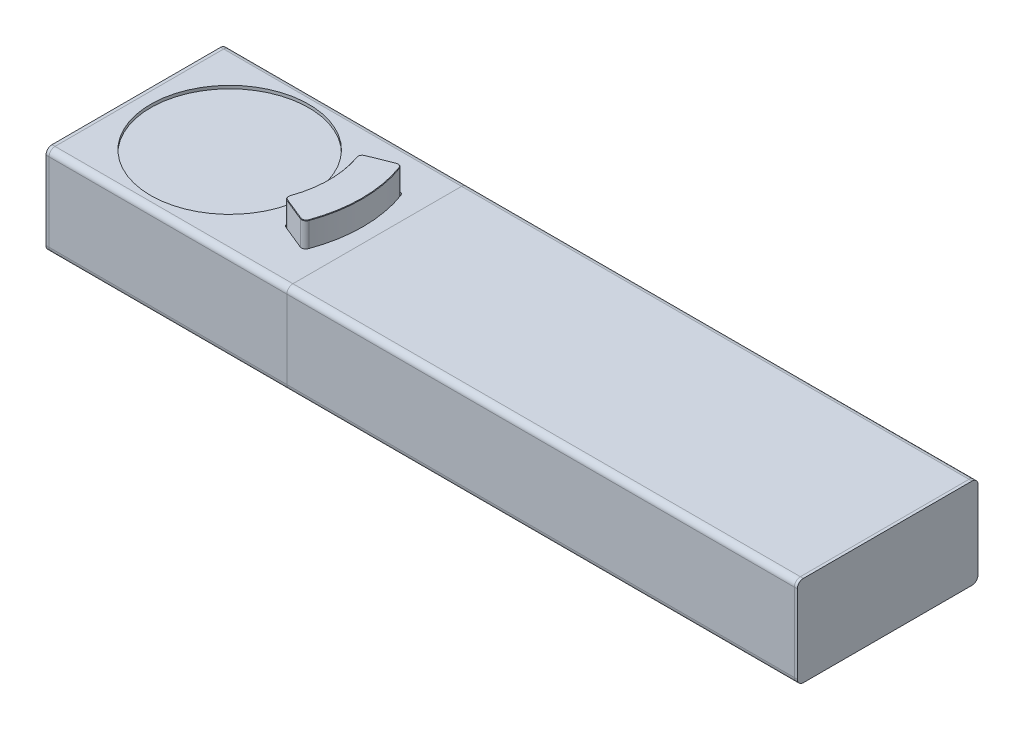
ISO-10303-21;
HEADER;
FILE_DESCRIPTION(('STEP AP214'),'2;1');
FILE_NAME('part.step','',(''),(''),'','','');
FILE_SCHEMA(('AUTOMOTIVE_DESIGN { 1 0 10303 214 1 1 1 1 }'));
ENDSEC;
DATA;
#1=APPLICATION_CONTEXT('core data for automotive mechanical design processes');
#2=APPLICATION_PROTOCOL_DEFINITION('international standard','automotive_design',2000,#1);
#3=PRODUCT_CONTEXT('',#1,'mechanical');
#4=PRODUCT('Part','Part','',(#3));
#5=PRODUCT_RELATED_PRODUCT_CATEGORY('part','',(#4));
#6=PRODUCT_DEFINITION_FORMATION('','',#4);
#7=PRODUCT_DEFINITION_CONTEXT('part definition',#1,'design');
#8=PRODUCT_DEFINITION('design','',#6,#7);
#9=PRODUCT_DEFINITION_SHAPE('','',#8);
#10=(LENGTH_UNIT() NAMED_UNIT(*) SI_UNIT(.MILLI.,.METRE.));
#11=(NAMED_UNIT(*) PLANE_ANGLE_UNIT() SI_UNIT($,.RADIAN.));
#12=(NAMED_UNIT(*) SI_UNIT($,.STERADIAN.) SOLID_ANGLE_UNIT());
#13=UNCERTAINTY_MEASURE_WITH_UNIT(LENGTH_MEASURE(1.E-05),#10,'distance_accuracy_value','');
#14=(GEOMETRIC_REPRESENTATION_CONTEXT(3) GLOBAL_UNCERTAINTY_ASSIGNED_CONTEXT((#13)) GLOBAL_UNIT_ASSIGNED_CONTEXT((#10,
#11,#12)) REPRESENTATION_CONTEXT('',''));
#15=CARTESIAN_POINT('',(0.,0.,0.));
#16=DIRECTION('',(0.,0.,1.));
#17=DIRECTION('',(1.,0.,0.));
#18=AXIS2_PLACEMENT_3D('',#15,#16,#17);
#19=CARTESIAN_POINT('',(55.,46.,0.));
#20=DIRECTION('',(0.,1.,0.));
#21=DIRECTION('',(0.,0.,1.));
#22=AXIS2_PLACEMENT_3D('',#19,#20,#21);
#23=PLANE('',#22);
#24=DIRECTION('',(0.927183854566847,1.60338755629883E-13,-0.374606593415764));
#25=VECTOR('',#24,1.);
#26=CARTESIAN_POINT('',(119.02757082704,46.0000000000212,-25.5452573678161));
#27=LINE('',#26,#25);
#28=CARTESIAN_POINT('',(119.027570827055,45.9999999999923,-25.5452573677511));
#29=VERTEX_POINT('',#28);
#30=CARTESIAN_POINT('',(133.873908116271,46.0000000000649,-31.5435669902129));
#31=VERTEX_POINT('',#30);
#32=EDGE_CURVE('P0_E116',#29,#31,#27,.T.);
#33=ORIENTED_EDGE('',*,*,#32,.F.);
#34=CARTESIAN_POINT('',(120.039008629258,45.9999999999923,-23.0418609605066));
#35=DIRECTION('',(0.,-1.,0.));
#36=DIRECTION('',(0.,0.,-1.));
#37=AXIS2_PLACEMENT_3D('',#34,#35,#36);
#38=CIRCLE('',#37,2.69999999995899);
#39=CARTESIAN_POINT('',(117.494003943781,45.9999999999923,-22.1402229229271));
#40=VERTEX_POINT('',#39);
#41=EDGE_CURVE('P0_E119',#40,#29,#38,.T.);
#42=ORIENTED_EDGE('',*,*,#41,.F.);
#43=CARTESIAN_POINT('',(55.,45.9999999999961,0.));
#44=DIRECTION('',(0.,1.,0.));
#45=DIRECTION('',(0.,0.,1.));
#46=AXIS2_PLACEMENT_3D('',#43,#44,#45);
#47=CIRCLE('',#46,66.2999999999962);
#48=CARTESIAN_POINT('',(117.494003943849,45.9999999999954,22.1402229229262));
#49=VERTEX_POINT('',#48);
#50=EDGE_CURVE('P0_E139',#40,#49,#47,.F.);
#51=ORIENTED_EDGE('',*,*,#50,.T.);
#52=CARTESIAN_POINT('',(120.039008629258,45.9999999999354,23.0418609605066));
#53=DIRECTION('',(0.,-1.,0.));
#54=DIRECTION('',(0.,0.,-1.));
#55=AXIS2_PLACEMENT_3D('',#52,#53,#54);
#56=CIRCLE('',#55,2.6999999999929);
#57=CARTESIAN_POINT('',(119.027570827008,45.9999999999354,25.5452573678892));
#58=VERTEX_POINT('',#57);
#59=EDGE_CURVE('P0_E107',#58,#49,#56,.T.);
#60=ORIENTED_EDGE('',*,*,#59,.F.);
#61=DIRECTION('',(-0.927183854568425,-4.3729145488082E-12,-0.374606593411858));
#62=VECTOR('',#61,1.);
#63=CARTESIAN_POINT('',(133.873908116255,46.0000000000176,31.5435669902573));
#64=LINE('',#63,#62);
#65=CARTESIAN_POINT('',(133.873908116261,46.0000000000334,31.5435669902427));
#66=VERTEX_POINT('',#65);
#67=EDGE_CURVE('P0_E99',#66,#58,#64,.T.);
#68=ORIENTED_EDGE('',*,*,#67,.F.);
#69=CARTESIAN_POINT('',(134.88534591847,46.0000000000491,29.0401705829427));
#70=DIRECTION('',(0.,-1.,0.));
#71=DIRECTION('',(0.,0.,-1.));
#72=AXIS2_PLACEMENT_3D('',#69,#70,#71);
#73=CIRCLE('',#72,2.69999999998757);
#74=CARTESIAN_POINT('',(137.422880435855,46.0000000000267,29.9626230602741));
#75=VERTEX_POINT('',#74);
#76=EDGE_CURVE('P0_E19',#75,#66,#73,.T.);
#77=ORIENTED_EDGE('',*,*,#76,.F.);
#78=CARTESIAN_POINT('',(55.,46.0000000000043,0.));
#79=DIRECTION('',(0.,-1.,0.));
#80=DIRECTION('',(0.,0.,-1.));
#81=AXIS2_PLACEMENT_3D('',#78,#79,#80);
#82=CIRCLE('',#81,87.6999999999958);
#83=CARTESIAN_POINT('',(137.422880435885,46.0000000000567,-29.9626230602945));
#84=VERTEX_POINT('',#83);
#85=EDGE_CURVE('P0_E95',#84,#75,#82,.T.);
#86=ORIENTED_EDGE('',*,*,#85,.F.);
#87=CARTESIAN_POINT('',(134.88534591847,46.000000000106,-29.0401705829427));
#88=DIRECTION('',(0.,-1.,0.));
#89=DIRECTION('',(0.,0.,-1.));
#90=AXIS2_PLACEMENT_3D('',#87,#88,#89);
#91=CIRCLE('',#90,2.70000000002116);
#92=EDGE_CURVE('P0_E144',#31,#84,#91,.T.);
#93=ORIENTED_EDGE('',*,*,#92,.F.);
#94=EDGE_LOOP('',(#33,#42,#51,#60,#68,#77,#86,#93));
#95=FACE_BOUND('',#94,.T.);
#96=ADVANCED_FACE('P0_F16',(#95),#23,.T.);
#97=CARTESIAN_POINT('',(134.88534591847,45.7000000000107,29.0401705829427));
#98=DIRECTION('',(0.,-1.,0.));
#99=DIRECTION('',(0.,0.,-1.));
#100=AXIS2_PLACEMENT_3D('',#97,#98,#99);
#101=CONICAL_SURFACE('',#100,2.9999999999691,0.785398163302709);
#102=DIRECTION('',(0.264886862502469,0.707106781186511,-0.655617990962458));
#103=VECTOR('',#102,1.);
#104=CARTESIAN_POINT('',(133.761526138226,45.7000000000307,31.8217221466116));
#105=LINE('',#104,#103);
#106=CARTESIAN_POINT('',(133.761526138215,45.7000000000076,31.8217221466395));
#107=VERTEX_POINT('',#106);
#108=EDGE_CURVE('P0_E88',#107,#66,#105,.T.);
#109=ORIENTED_EDGE('',*,*,#108,.F.);
#110=CARTESIAN_POINT('',(134.88534591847,45.7000000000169,29.0401705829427));
#111=DIRECTION('',(0.,-1.,0.));
#112=DIRECTION('',(0.,0.,-1.));
#113=AXIS2_PLACEMENT_3D('',#110,#111,#112);
#114=CIRCLE('',#113,3.);
#115=CARTESIAN_POINT('',(137.704828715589,45.7000000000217,30.0651177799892));
#116=VERTEX_POINT('',#115);
#117=EDGE_CURVE('P0_E111',#116,#107,#114,.T.);
#118=ORIENTED_EDGE('',*,*,#117,.F.);
#119=DIRECTION('',(-0.664558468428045,0.707106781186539,-0.241582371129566));
#120=VECTOR('',#119,1.);
#121=CARTESIAN_POINT('',(137.704828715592,45.7,30.0651177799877));
#122=LINE('',#121,#120);
#123=EDGE_CURVE('P0_E91',#75,#116,#122,.F.);
#124=ORIENTED_EDGE('',*,*,#123,.F.);
#125=ORIENTED_EDGE('',*,*,#76,.T.);
#126=EDGE_LOOP('',(#109,#118,#124,#125));
#127=FACE_BOUND('',#126,.T.);
#128=ADVANCED_FACE('P0_F85',(#127),#101,.T.);
#129=CARTESIAN_POINT('',(55.,45.7000000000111,0.));
#130=DIRECTION('',(0.,-1.,0.));
#131=DIRECTION('',(0.,0.,-1.));
#132=AXIS2_PLACEMENT_3D('',#129,#130,#131);
#133=CONICAL_SURFACE('',#132,87.9999999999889,0.785398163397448);
#134=ORIENTED_EDGE('',*,*,#85,.T.);
#135=ORIENTED_EDGE('',*,*,#123,.T.);
#136=CARTESIAN_POINT('',(55.,45.7000000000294,0.));
#137=DIRECTION('',(0.,-1.,0.));
#138=DIRECTION('',(0.,0.,-1.));
#139=AXIS2_PLACEMENT_3D('',#136,#137,#138);
#140=CIRCLE('',#139,88.);
#141=CARTESIAN_POINT('',(137.704828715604,45.7000000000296,-30.0651177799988));
#142=VERTEX_POINT('',#141);
#143=EDGE_CURVE('P0_E152',#142,#116,#140,.T.);
#144=ORIENTED_EDGE('',*,*,#143,.F.);
#145=CARTESIAN_POINT('',(137.422880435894,46.000000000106,-29.9626230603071));
#146=CARTESIAN_POINT('',(137.434628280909,45.9875000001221,-29.9668936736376));
#147=CARTESIAN_POINT('',(137.446376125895,45.9750000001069,-29.9711642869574));
#148=CARTESIAN_POINT('',(137.469871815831,45.9500000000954,-29.9797055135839));
#149=CARTESIAN_POINT('',(137.481619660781,45.9375000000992,-29.9839761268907));
#150=CARTESIAN_POINT('',(137.505115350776,45.9125000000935,-29.9925173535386));
#151=CARTESIAN_POINT('',(137.51686319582,45.9000000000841,-29.9967879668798));
#152=CARTESIAN_POINT('',(137.540358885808,45.8750000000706,-30.005329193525));
#153=CARTESIAN_POINT('',(137.552106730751,45.8625000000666,-30.0095998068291));
#154=CARTESIAN_POINT('',(137.575602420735,45.8375000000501,-30.0181410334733));
#155=CARTESIAN_POINT('',(137.587350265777,45.8250000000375,-30.0224116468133));
#156=CARTESIAN_POINT('',(137.610845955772,45.8000000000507,-30.0309528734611));
#157=CARTESIAN_POINT('',(137.622593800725,45.7875000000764,-30.0352234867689));
#158=CARTESIAN_POINT('',(137.646089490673,45.7625000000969,-30.0437647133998));
#159=CARTESIAN_POINT('',(137.657837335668,45.7500000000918,-30.0480353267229));
#160=CARTESIAN_POINT('',(137.681333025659,45.7250000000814,-30.0565765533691));
#161=CARTESIAN_POINT('',(137.693080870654,45.7125000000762,-30.0608471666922));
#162=CARTESIAN_POINT('',(137.704828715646,45.7000000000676,-30.065117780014));
#163=B_SPLINE_CURVE_WITH_KNOTS('',3,(#145,#146,#147,#148,#149,#150,#151,#152,#153,#154,#155,
#156,#157,#158,#159,#160,#161,#162),.UNSPECIFIED.,.F.,.F.,(4,2,2,2,2,2,2,2,4),(0.,
0.0530330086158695,0.106066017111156,0.159099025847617,0.212132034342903,0.265165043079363,
0.318198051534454,0.371231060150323,0.424264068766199),.UNSPECIFIED.);
#164=EDGE_CURVE('P0_E145',#84,#142,#163,.T.);
#165=ORIENTED_EDGE('',*,*,#164,.F.);
#166=EDGE_LOOP('',(#134,#135,#144,#165));
#167=FACE_BOUND('',#166,.T.);
#168=ADVANCED_FACE('P0_F150',(#167),#133,.T.);
#169=CARTESIAN_POINT('',(134.88534591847,45.7000000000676,-29.0401705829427));
#170=DIRECTION('',(0.,-1.,0.));
#171=DIRECTION('',(0.,0.,-1.));
#172=AXIS2_PLACEMENT_3D('',#169,#170,#171);
#173=CONICAL_SURFACE('',#172,3.00000000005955,0.785398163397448);
#174=ORIENTED_EDGE('',*,*,#164,.T.);
#175=CARTESIAN_POINT('',(134.88534591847,45.7000000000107,-29.0401705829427));
#176=DIRECTION('',(0.,-1.,0.));
#177=DIRECTION('',(0.,0.,-1.));
#178=AXIS2_PLACEMENT_3D('',#175,#176,#177);
#179=CIRCLE('',#178,3.);
#180=CARTESIAN_POINT('',(133.761526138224,45.7000000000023,-31.8217221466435));
#181=VERTEX_POINT('',#180);
#182=EDGE_CURVE('P0_E174',#181,#142,#179,.T.);
#183=ORIENTED_EDGE('',*,*,#182,.F.);
#184=DIRECTION('',(-0.264886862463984,-0.707106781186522,-0.655617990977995));
#185=VECTOR('',#184,1.);
#186=CARTESIAN_POINT('',(133.873908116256,46.0000000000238,-31.5435669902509));
#187=LINE('',#186,#185);
#188=EDGE_CURVE('P0_E120',#31,#181,#187,.T.);
#189=ORIENTED_EDGE('',*,*,#188,.F.);
#190=ORIENTED_EDGE('',*,*,#92,.T.);
#191=EDGE_LOOP('',(#174,#183,#189,#190));
#192=FACE_BOUND('',#191,.T.);
#193=ADVANCED_FACE('P0_F216',(#192),#173,.T.);
#194=CARTESIAN_POINT('',(55.1123819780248,46.,0.278155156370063));
#195=DIRECTION('',(-0.264886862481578,0.707106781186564,-0.655617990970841));
#196=DIRECTION('',(0.,0.679904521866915,0.733300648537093));
#197=AXIS2_PLACEMENT_3D('',#194,#195,#196);
#198=PLANE('',#197);
#199=DIRECTION('',(0.264886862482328,0.707106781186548,0.655617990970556));
#200=VECTOR('',#199,1.);
#201=CARTESIAN_POINT('',(-186800.019473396,-498928.25813904,-462666.421248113));
#202=LINE('',#201,#200);
#203=CARTESIAN_POINT('',(118.915188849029,45.700000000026,-25.8234125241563));
#204=VERTEX_POINT('',#203);
#205=EDGE_CURVE('P0_E143',#29,#204,#202,.F.);
#206=ORIENTED_EDGE('',*,*,#205,.F.);
#207=ORIENTED_EDGE('',*,*,#32,.T.);
#208=ORIENTED_EDGE('',*,*,#188,.T.);
#209=DIRECTION('',(0.927183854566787,0.,-0.374606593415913));
#210=VECTOR('',#209,1.);
#211=CARTESIAN_POINT('',(116.194134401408,45.7000000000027,-24.7240351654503));
#212=LINE('',#211,#210);
#213=EDGE_CURVE('P0_E202',#181,#204,#212,.F.);
#214=ORIENTED_EDGE('',*,*,#213,.T.);
#215=EDGE_LOOP('',(#206,#207,#208,#214));
#216=FACE_BOUND('',#215,.T.);
#217=ADVANCED_FACE('P0_F214',(#216),#198,.T.);
#218=CARTESIAN_POINT('',(120.039008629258,45.7000000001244,-23.0418609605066));
#219=DIRECTION('',(0.,-1.,0.));
#220=DIRECTION('',(0.,0.,-1.));
#221=AXIS2_PLACEMENT_3D('',#218,#219,#220);
#222=CONICAL_SURFACE('',#221,2.99999999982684,0.785398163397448);
#223=ORIENTED_EDGE('',*,*,#205,.T.);
#224=CARTESIAN_POINT('',(120.039008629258,45.6999999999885,-23.0418609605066));
#225=DIRECTION('',(0.,-1.,0.));
#226=DIRECTION('',(0.,0.,-1.));
#227=AXIS2_PLACEMENT_3D('',#224,#225,#226);
#228=CIRCLE('',#227,3.);
#229=CARTESIAN_POINT('',(117.211225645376,45.6999999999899,-22.040040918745));
#230=VERTEX_POINT('',#229);
#231=EDGE_CURVE('P0_E196',#230,#204,#228,.T.);
#232=ORIENTED_EDGE('',*,*,#231,.F.);
#233=DIRECTION('',(-0.666514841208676,-0.707106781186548,0.236131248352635));
#234=VECTOR('',#233,1.);
#235=CARTESIAN_POINT('',(117.494003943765,46.,-22.1402229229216));
#236=LINE('',#235,#234);
#237=EDGE_CURVE('P0_E141',#230,#40,#236,.F.);
#238=ORIENTED_EDGE('',*,*,#237,.T.);
#239=ORIENTED_EDGE('',*,*,#41,.T.);
#240=EDGE_LOOP('',(#223,#232,#238,#239));
#241=FACE_BOUND('',#240,.T.);
#242=ADVANCED_FACE('P0_F324',(#241),#222,.T.);
#243=CARTESIAN_POINT('',(55.,45.9999999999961,0.));
#244=DIRECTION('',(0.,1.,0.));
#245=DIRECTION('',(0.,0.,1.));
#246=AXIS2_PLACEMENT_3D('',#243,#244,#245);
#247=CONICAL_SURFACE('',#246,66.2999999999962,0.785398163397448);
#248=DIRECTION('',(0.666514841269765,0.707106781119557,0.23613124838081));
#249=VECTOR('',#248,1.);
#250=CARTESIAN_POINT('',(-470256.249769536,-498974.341766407,-166620.719688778));
#251=LINE('',#250,#249);
#252=CARTESIAN_POINT('',(117.211225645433,45.7000000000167,22.0400409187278));
#253=VERTEX_POINT('',#252);
#254=EDGE_CURVE('P0_E103',#49,#253,#251,.F.);
#255=ORIENTED_EDGE('',*,*,#254,.F.);
#256=ORIENTED_EDGE('',*,*,#50,.F.);
#257=ORIENTED_EDGE('',*,*,#237,.F.);
#258=CARTESIAN_POINT('',(55.,45.6999999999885,0.));
#259=DIRECTION('',(0.,-1.,0.));
#260=DIRECTION('',(0.,0.,-1.));
#261=AXIS2_PLACEMENT_3D('',#258,#259,#260);
#262=CIRCLE('',#261,66.);
#263=EDGE_CURVE('P0_E190',#230,#253,#262,.T.);
#264=ORIENTED_EDGE('',*,*,#263,.T.);
#265=EDGE_LOOP('',(#255,#256,#257,#264));
#266=FACE_BOUND('',#265,.T.);
#267=ADVANCED_FACE('P0_F321',(#266),#247,.F.);
#268=CARTESIAN_POINT('',(120.039008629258,45.7000000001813,23.0418609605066));
#269=DIRECTION('',(0.,-1.,0.));
#270=DIRECTION('',(0.,0.,-1.));
#271=AXIS2_PLACEMENT_3D('',#268,#269,#270);
#272=CONICAL_SURFACE('',#271,2.9999999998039,0.785398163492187);
#273=ORIENTED_EDGE('',*,*,#254,.T.);
#274=CARTESIAN_POINT('',(120.039008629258,45.7000000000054,23.0418609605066));
#275=DIRECTION('',(0.,-1.,0.));
#276=DIRECTION('',(0.,0.,-1.));
#277=AXIS2_PLACEMENT_3D('',#274,#275,#276);
#278=CIRCLE('',#277,3.);
#279=CARTESIAN_POINT('',(118.915188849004,45.7000000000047,25.8234125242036));
#280=VERTEX_POINT('',#279);
#281=EDGE_CURVE('P0_E181',#280,#253,#278,.T.);
#282=ORIENTED_EDGE('',*,*,#281,.F.);
#283=DIRECTION('',(-0.264886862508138,-0.707106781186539,0.655617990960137));
#284=VECTOR('',#283,1.);
#285=CARTESIAN_POINT('',(119.027570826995,45.9999999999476,25.5452573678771));
#286=LINE('',#285,#284);
#287=EDGE_CURVE('P0_E109',#58,#280,#286,.T.);
#288=ORIENTED_EDGE('',*,*,#287,.F.);
#289=ORIENTED_EDGE('',*,*,#59,.T.);
#290=EDGE_LOOP('',(#273,#282,#288,#289));
#291=FACE_BOUND('',#290,.T.);
#292=ADVANCED_FACE('P0_F318',(#291),#272,.T.);
#293=CARTESIAN_POINT('',(55.1123819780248,46.,-0.278155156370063));
#294=DIRECTION('',(-0.264886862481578,0.707106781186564,0.655617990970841));
#295=DIRECTION('',(0.,-0.679904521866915,0.733300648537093));
#296=AXIS2_PLACEMENT_3D('',#293,#294,#295);
#297=PLANE('',#296);
#298=ORIENTED_EDGE('',*,*,#287,.T.);
#299=DIRECTION('',(-0.927183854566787,0.,-0.374606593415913));
#300=VECTOR('',#299,1.);
#301=CARTESIAN_POINT('',(116.194134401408,45.7000000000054,24.7240351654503));
#302=LINE('',#301,#300);
#303=EDGE_CURVE('P0_E102',#280,#107,#302,.F.);
#304=ORIENTED_EDGE('',*,*,#303,.T.);
#305=ORIENTED_EDGE('',*,*,#108,.T.);
#306=ORIENTED_EDGE('',*,*,#67,.T.);
#307=EDGE_LOOP('',(#298,#304,#305,#306));
#308=FACE_BOUND('',#307,.T.);
#309=ADVANCED_FACE('P0_F98',(#308),#297,.T.);
#310=CARTESIAN_POINT('',(134.88534591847,46.,29.0401705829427));
#311=DIRECTION('',(0.,-1.,0.));
#312=DIRECTION('',(0.,0.,-1.));
#313=AXIS2_PLACEMENT_3D('',#310,#311,#312);
#314=CYLINDRICAL_SURFACE('',#313,3.);
#315=DIRECTION('',(0.,-1.,0.));
#316=VECTOR('',#315,1.);
#317=CARTESIAN_POINT('',(137.704828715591,46.,30.0651177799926));
#318=LINE('',#317,#316);
#319=CARTESIAN_POINT('',(137.704828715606,28.3000000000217,30.0651177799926));
#320=VERTEX_POINT('',#319);
#321=EDGE_CURVE('P0_E160',#116,#320,#318,.T.);
#322=ORIENTED_EDGE('',*,*,#321,.F.);
#323=ORIENTED_EDGE('',*,*,#117,.T.);
#324=DIRECTION('',(0.,1.,0.));
#325=VECTOR('',#324,1.);
#326=CARTESIAN_POINT('',(133.761526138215,46.,31.8217221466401));
#327=LINE('',#326,#325);
#328=CARTESIAN_POINT('',(133.761526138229,28.2999999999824,31.821722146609));
#329=VERTEX_POINT('',#328);
#330=EDGE_CURVE('P0_E184',#107,#329,#327,.F.);
#331=ORIENTED_EDGE('',*,*,#330,.T.);
#332=CARTESIAN_POINT('',(134.88534591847,28.3000000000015,29.0401705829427));
#333=DIRECTION('',(0.,1.,0.));
#334=DIRECTION('',(0.,0.,1.));
#335=AXIS2_PLACEMENT_3D('',#332,#333,#334);
#336=CIRCLE('',#335,3.0000000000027);
#337=EDGE_CURVE('P0_E172',#320,#329,#336,.F.);
#338=ORIENTED_EDGE('',*,*,#337,.F.);
#339=EDGE_LOOP('',(#322,#323,#331,#338));
#340=FACE_BOUND('',#339,.T.);
#341=ADVANCED_FACE('P0_F170',(#340),#314,.T.);
#342=CARTESIAN_POINT('',(55.,46.,0.));
#343=DIRECTION('',(0.,-1.,0.));
#344=DIRECTION('',(0.,0.,-1.));
#345=AXIS2_PLACEMENT_3D('',#342,#343,#344);
#346=CYLINDRICAL_SURFACE('',#345,88.);
#347=ORIENTED_EDGE('',*,*,#143,.T.);
#348=ORIENTED_EDGE('',*,*,#321,.T.);
#349=CARTESIAN_POINT('',(55.,28.3000000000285,0.));
#350=DIRECTION('',(0.,1.,0.));
#351=DIRECTION('',(0.,0.,1.));
#352=AXIS2_PLACEMENT_3D('',#349,#350,#351);
#353=CIRCLE('',#352,88.0000000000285);
#354=CARTESIAN_POINT('',(137.704828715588,28.2999999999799,-30.0651177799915));
#355=VERTEX_POINT('',#354);
#356=EDGE_CURVE('P0_E359',#355,#320,#353,.F.);
#357=ORIENTED_EDGE('',*,*,#356,.F.);
#358=DIRECTION('',(0.,-1.,0.));
#359=VECTOR('',#358,1.);
#360=CARTESIAN_POINT('',(137.70482871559,46.,-30.0651177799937));
#361=LINE('',#360,#359);
#362=EDGE_CURVE('P0_E163',#142,#355,#361,.T.);
#363=ORIENTED_EDGE('',*,*,#362,.F.);
#364=EDGE_LOOP('',(#347,#348,#357,#363));
#365=FACE_BOUND('',#364,.T.);
#366=ADVANCED_FACE('P0_F156',(#365),#346,.T.);
#367=CARTESIAN_POINT('',(134.88534591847,46.,-29.0401705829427));
#368=DIRECTION('',(0.,-1.,0.));
#369=DIRECTION('',(0.,0.,-1.));
#370=AXIS2_PLACEMENT_3D('',#367,#368,#369);
#371=CYLINDRICAL_SURFACE('',#370,3.);
#372=ORIENTED_EDGE('',*,*,#362,.T.);
#373=CARTESIAN_POINT('',(134.88534591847,28.3000000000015,-29.0401705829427));
#374=DIRECTION('',(0.,1.,0.));
#375=DIRECTION('',(0.,0.,1.));
#376=AXIS2_PLACEMENT_3D('',#373,#374,#375);
#377=CIRCLE('',#376,3.00000000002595);
#378=CARTESIAN_POINT('',(133.761526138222,28.3,-31.8217221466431));
#379=VERTEX_POINT('',#378);
#380=EDGE_CURVE('P0_E362',#379,#355,#377,.F.);
#381=ORIENTED_EDGE('',*,*,#380,.F.);
#382=DIRECTION('',(0.,1.,0.));
#383=VECTOR('',#382,1.);
#384=CARTESIAN_POINT('',(133.761526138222,46.,-31.8217221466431));
#385=LINE('',#384,#383);
#386=EDGE_CURVE('P0_E205',#379,#181,#385,.T.);
#387=ORIENTED_EDGE('',*,*,#386,.T.);
#388=ORIENTED_EDGE('',*,*,#182,.T.);
#389=EDGE_LOOP('',(#372,#381,#387,#388));
#390=FACE_BOUND('',#389,.T.);
#391=ADVANCED_FACE('P0_F307',(#390),#371,.T.);
#392=CARTESIAN_POINT('',(116.194134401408,46.,-24.7240351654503));
#393=DIRECTION('',(0.374606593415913,0.,0.927183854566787));
#394=DIRECTION('',(0.927183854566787,0.,-0.374606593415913));
#395=AXIS2_PLACEMENT_3D('',#392,#393,#394);
#396=PLANE('',#395);
#397=ORIENTED_EDGE('',*,*,#386,.F.);
#398=DIRECTION('',(-0.927183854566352,-1.16007256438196E-12,0.374606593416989));
#399=VECTOR('',#398,1.);
#400=CARTESIAN_POINT('',(133.761526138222,28.3,-31.8217221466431));
#401=LINE('',#400,#399);
#402=CARTESIAN_POINT('',(118.915188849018,28.2999999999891,-25.8234125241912));
#403=VERTEX_POINT('',#402);
#404=EDGE_CURVE('P0_E352',#379,#403,#401,.T.);
#405=ORIENTED_EDGE('',*,*,#404,.T.);
#406=DIRECTION('',(0.,-1.,0.));
#407=VECTOR('',#406,1.);
#408=CARTESIAN_POINT('',(118.915188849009,46.,-25.8234125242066));
#409=LINE('',#408,#407);
#410=EDGE_CURVE('P0_E199',#204,#403,#409,.T.);
#411=ORIENTED_EDGE('',*,*,#410,.F.);
#412=ORIENTED_EDGE('',*,*,#213,.F.);
#413=EDGE_LOOP('',(#397,#405,#411,#412));
#414=FACE_BOUND('',#413,.T.);
#415=ADVANCED_FACE('P0_F303',(#414),#396,.F.);
#416=CARTESIAN_POINT('',(120.039008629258,46.,-23.0418609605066));
#417=DIRECTION('',(0.,-1.,0.));
#418=DIRECTION('',(0.,0.,-1.));
#419=AXIS2_PLACEMENT_3D('',#416,#417,#418);
#420=CYLINDRICAL_SURFACE('',#419,3.);
#421=DIRECTION('',(0.,-1.,0.));
#422=VECTOR('',#421,1.);
#423=CARTESIAN_POINT('',(117.211225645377,46.,-22.0400409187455));
#424=LINE('',#423,#422);
#425=CARTESIAN_POINT('',(117.211225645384,28.3000000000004,-22.0400409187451));
#426=VERTEX_POINT('',#425);
#427=EDGE_CURVE('P0_E193',#426,#230,#424,.F.);
#428=ORIENTED_EDGE('',*,*,#427,.T.);
#429=ORIENTED_EDGE('',*,*,#231,.T.);
#430=ORIENTED_EDGE('',*,*,#410,.T.);
#431=CARTESIAN_POINT('',(120.039008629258,28.3000000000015,-23.0418609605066));
#432=DIRECTION('',(0.,1.,0.));
#433=DIRECTION('',(0.,0.,1.));
#434=AXIS2_PLACEMENT_3D('',#431,#432,#433);
#435=CIRCLE('',#434,2.99999999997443);
#436=EDGE_CURVE('P0_E386',#426,#403,#435,.F.);
#437=ORIENTED_EDGE('',*,*,#436,.F.);
#438=EDGE_LOOP('',(#428,#429,#430,#437));
#439=FACE_BOUND('',#438,.T.);
#440=ADVANCED_FACE('P0_F299',(#439),#420,.T.);
#441=CARTESIAN_POINT('',(55.,46.,0.));
#442=DIRECTION('',(0.,-1.,0.));
#443=DIRECTION('',(0.,0.,-1.));
#444=AXIS2_PLACEMENT_3D('',#441,#442,#443);
#445=CYLINDRICAL_SURFACE('',#444,66.);
#446=ORIENTED_EDGE('',*,*,#427,.F.);
#447=CARTESIAN_POINT('',(55.,28.3,0.));
#448=DIRECTION('',(0.,-1.,0.));
#449=DIRECTION('',(0.,0.,-1.));
#450=AXIS2_PLACEMENT_3D('',#447,#448,#449);
#451=CIRCLE('',#450,66.);
#452=CARTESIAN_POINT('',(117.211225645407,28.3000000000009,22.0400409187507));
#453=VERTEX_POINT('',#452);
#454=EDGE_CURVE('P0_E262',#426,#453,#451,.T.);
#455=ORIENTED_EDGE('',*,*,#454,.T.);
#456=DIRECTION('',(0.,-1.,0.));
#457=VECTOR('',#456,1.);
#458=CARTESIAN_POINT('',(117.211225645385,46.,22.0400409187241));
#459=LINE('',#458,#457);
#460=EDGE_CURVE('P0_E185',#253,#453,#459,.T.);
#461=ORIENTED_EDGE('',*,*,#460,.F.);
#462=ORIENTED_EDGE('',*,*,#263,.F.);
#463=EDGE_LOOP('',(#446,#455,#461,#462));
#464=FACE_BOUND('',#463,.T.);
#465=ADVANCED_FACE('P0_F295',(#464),#445,.F.);
#466=CARTESIAN_POINT('',(120.039008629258,46.,23.0418609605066));
#467=DIRECTION('',(0.,-1.,0.));
#468=DIRECTION('',(0.,0.,-1.));
#469=AXIS2_PLACEMENT_3D('',#466,#467,#468);
#470=CYLINDRICAL_SURFACE('',#469,3.);
#471=DIRECTION('',(0.,1.,0.));
#472=VECTOR('',#471,1.);
#473=CARTESIAN_POINT('',(118.915188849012,46.,25.8234125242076));
#474=LINE('',#473,#472);
#475=CARTESIAN_POINT('',(118.91518884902,28.2999999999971,25.8234125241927));
#476=VERTEX_POINT('',#475);
#477=EDGE_CURVE('P0_E186',#476,#280,#474,.T.);
#478=ORIENTED_EDGE('',*,*,#477,.T.);
#479=ORIENTED_EDGE('',*,*,#281,.T.);
#480=ORIENTED_EDGE('',*,*,#460,.T.);
#481=CARTESIAN_POINT('',(120.039008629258,28.3000000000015,23.0418609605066));
#482=DIRECTION('',(0.,1.,0.));
#483=DIRECTION('',(0.,0.,1.));
#484=AXIS2_PLACEMENT_3D('',#481,#482,#483);
#485=CIRCLE('',#484,2.99999999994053);
#486=EDGE_CURVE('P0_E253',#476,#453,#485,.F.);
#487=ORIENTED_EDGE('',*,*,#486,.F.);
#488=EDGE_LOOP('',(#478,#479,#480,#487));
#489=FACE_BOUND('',#488,.T.);
#490=ADVANCED_FACE('P0_F291',(#489),#470,.T.);
#491=CARTESIAN_POINT('',(116.194134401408,46.,24.7240351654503));
#492=DIRECTION('',(0.374606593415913,0.,-0.927183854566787));
#493=DIRECTION('',(-0.927183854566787,0.,-0.374606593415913));
#494=AXIS2_PLACEMENT_3D('',#491,#492,#493);
#495=PLANE('',#494);
#496=ORIENTED_EDGE('',*,*,#477,.F.);
#497=DIRECTION('',(0.927183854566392,1.05455232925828E-12,0.374606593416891));
#498=VECTOR('',#497,1.);
#499=CARTESIAN_POINT('',(118.915188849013,28.2999999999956,25.8234125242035));
#500=LINE('',#499,#498);
#501=EDGE_CURVE('P0_E373',#476,#329,#500,.T.);
#502=ORIENTED_EDGE('',*,*,#501,.T.);
#503=ORIENTED_EDGE('',*,*,#330,.F.);
#504=ORIENTED_EDGE('',*,*,#303,.F.);
#505=EDGE_LOOP('',(#496,#502,#503,#504));
#506=FACE_BOUND('',#505,.T.);
#507=ADVANCED_FACE('P0_F287',(#506),#495,.F.);
#508=CARTESIAN_POINT('',(55.,28.3000000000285,0.));
#509=DIRECTION('',(0.,1.,0.));
#510=DIRECTION('',(-1.,0.,0.));
#511=AXIS2_PLACEMENT_3D('',#508,#509,#510);
#512=CONICAL_SURFACE('',#511,88.0000000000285,0.785398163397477);
#513=DIRECTION('',(-0.664558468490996,-0.707106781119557,0.241582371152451));
#514=VECTOR('',#513,1.);
#515=CARTESIAN_POINT('',(469085.079717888,499000.,-170503.28025668));
#516=LINE('',#515,#514);
#517=CARTESIAN_POINT('',(137.4228804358,27.9999999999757,-29.9626230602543));
#518=VERTEX_POINT('',#517);
#519=EDGE_CURVE('P0_E360',#355,#518,#516,.T.);
#520=ORIENTED_EDGE('',*,*,#519,.F.);
#521=ORIENTED_EDGE('',*,*,#356,.T.);
#522=DIRECTION('',(-0.664558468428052,-0.707106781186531,-0.241582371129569));
#523=VECTOR('',#522,1.);
#524=CARTESIAN_POINT('',(137.704828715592,28.3,30.0651177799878));
#525=LINE('',#524,#523);
#526=CARTESIAN_POINT('',(137.422880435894,28.000000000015,29.9626230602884));
#527=VERTEX_POINT('',#526);
#528=EDGE_CURVE('P0_E361',#320,#527,#525,.T.);
#529=ORIENTED_EDGE('',*,*,#528,.T.);
#530=CARTESIAN_POINT('',(55.,28.00000000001,0.));
#531=DIRECTION('',(0.,1.,0.));
#532=DIRECTION('',(-1.,0.,0.));
#533=AXIS2_PLACEMENT_3D('',#530,#531,#532);
#534=CIRCLE('',#533,87.70000000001);
#535=EDGE_CURVE('P0_E133',#527,#518,#534,.T.);
#536=ORIENTED_EDGE('',*,*,#535,.T.);
#537=EDGE_LOOP('',(#520,#521,#529,#536));
#538=FACE_BOUND('',#537,.T.);
#539=ADVANCED_FACE('P0_F283',(#538),#512,.T.);
#540=CARTESIAN_POINT('',(134.88534591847,28.2999999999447,-29.0401705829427));
#541=DIRECTION('',(0.,1.,0.));
#542=DIRECTION('',(0.,0.,1.));
#543=AXIS2_PLACEMENT_3D('',#540,#541,#542);
#544=CONICAL_SURFACE('',#543,2.99999999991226,0.785398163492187);
#545=DIRECTION('',(-0.264886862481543,0.707106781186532,-0.655617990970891));
#546=VECTOR('',#545,1.);
#547=CARTESIAN_POINT('',(133.873908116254,27.9999999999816,-31.5435669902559));
#548=LINE('',#547,#546);
#549=CARTESIAN_POINT('',(133.873908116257,28.0000000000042,-31.5435669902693));
#550=VERTEX_POINT('',#549);
#551=EDGE_CURVE('P0_E364',#550,#379,#548,.T.);
#552=ORIENTED_EDGE('',*,*,#551,.T.);
#553=ORIENTED_EDGE('',*,*,#380,.T.);
#554=ORIENTED_EDGE('',*,*,#519,.T.);
#555=CARTESIAN_POINT('',(134.88534591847,28.0000000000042,-29.0401705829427));
#556=DIRECTION('',(0.,1.,0.));
#557=DIRECTION('',(0.,0.,1.));
#558=AXIS2_PLACEMENT_3D('',#555,#556,#557);
#559=CIRCLE('',#558,2.69999999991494);
#560=EDGE_CURVE('P0_E130',#518,#550,#559,.T.);
#561=ORIENTED_EDGE('',*,*,#560,.T.);
#562=EDGE_LOOP('',(#552,#553,#554,#561));
#563=FACE_BOUND('',#562,.T.);
#564=ADVANCED_FACE('P0_F279',(#563),#544,.T.);
#565=CARTESIAN_POINT('',(116.194134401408,28.3,-24.7240351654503));
#566=DIRECTION('',(0.26488686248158,0.70710678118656,0.655617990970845));
#567=DIRECTION('',(0.,-0.67990452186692,0.733300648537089));
#568=AXIS2_PLACEMENT_3D('',#565,#566,#567);
#569=PLANE('',#568);
#570=ORIENTED_EDGE('',*,*,#551,.F.);
#571=DIRECTION('',(-0.927183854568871,0.,0.374606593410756));
#572=VECTOR('',#571,1.);
#573=CARTESIAN_POINT('',(133.873908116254,28.,-31.5435669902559));
#574=LINE('',#573,#572);
#575=CARTESIAN_POINT('',(119.027570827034,28.0000000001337,-25.5452573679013));
#576=VERTEX_POINT('',#575);
#577=EDGE_CURVE('P0_E129',#550,#576,#574,.T.);
#578=ORIENTED_EDGE('',*,*,#577,.T.);
#579=CARTESIAN_POINT('',(118.915188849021,28.3000000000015,-25.8234125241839));
#580=CARTESIAN_POINT('',(118.919871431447,28.2875000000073,-25.8118227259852));
#581=CARTESIAN_POINT('',(118.924554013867,28.2749999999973,-25.8002329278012));
#582=CARTESIAN_POINT('',(118.933919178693,28.2499999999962,-25.7770533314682));
#583=CARTESIAN_POINT('',(118.938601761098,28.2375000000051,-25.7654635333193));
#584=CARTESIAN_POINT('',(118.947966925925,28.2125000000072,-25.7422839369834));
#585=CARTESIAN_POINT('',(118.952649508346,28.2000000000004,-25.7306941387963));
#586=CARTESIAN_POINT('',(118.962014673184,28.1750000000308,-25.7075145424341));
#587=CARTESIAN_POINT('',(118.9666972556,28.162500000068,-25.695924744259));
#588=CARTESIAN_POINT('',(118.976062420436,28.1375000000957,-25.6727451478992));
#589=CARTESIAN_POINT('',(118.980745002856,28.1250000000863,-25.6611553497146));
#590=CARTESIAN_POINT('',(118.990110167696,28.1000000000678,-25.6379757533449));
#591=CARTESIAN_POINT('',(118.994792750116,28.0875000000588,-25.6263859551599));
#592=CARTESIAN_POINT('',(119.004157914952,28.0625000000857,-25.6032063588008));
#593=CARTESIAN_POINT('',(119.008840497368,28.0500000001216,-25.5916165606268));
#594=CARTESIAN_POINT('',(119.018205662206,28.0250000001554,-25.5684369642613));
#595=CARTESIAN_POINT('',(119.022888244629,28.0125000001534,-25.5568471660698));
#596=CARTESIAN_POINT('',(119.027570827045,28.0000000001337,-25.5452573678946));
#597=B_SPLINE_CURVE_WITH_KNOTS('',3,(#579,#580,#581,#582,#583,#584,#585,#586,#587,#588,#589,
#590,#591,#592,#593,#594,#595,#596),.UNSPECIFIED.,.F.,.F.,(4,2,2,2,2,2,2,2,4),(0.,
0.0530330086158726,0.106066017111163,0.159099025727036,0.212132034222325,0.265165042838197,
0.318198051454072,0.371231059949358,0.424264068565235),.UNSPECIFIED.);
#598=EDGE_CURVE('P0_E263',#403,#576,#597,.T.);
#599=ORIENTED_EDGE('',*,*,#598,.F.);
#600=ORIENTED_EDGE('',*,*,#404,.F.);
#601=EDGE_LOOP('',(#570,#578,#599,#600));
#602=FACE_BOUND('',#601,.T.);
#603=ADVANCED_FACE('P0_F275',(#602),#569,.F.);
#604=CARTESIAN_POINT('',(120.039008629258,28.3000000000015,-23.0418609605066));
#605=DIRECTION('',(0.,1.,0.));
#606=DIRECTION('',(0.,0.,1.));
#607=AXIS2_PLACEMENT_3D('',#604,#605,#606);
#608=CONICAL_SURFACE('',#607,2.99999999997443,0.785398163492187);
#609=ORIENTED_EDGE('',*,*,#598,.T.);
#610=CARTESIAN_POINT('',(120.039008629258,28.0000000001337,-23.0418609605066));
#611=DIRECTION('',(0.,1.,0.));
#612=DIRECTION('',(0.,0.,1.));
#613=AXIS2_PLACEMENT_3D('',#610,#611,#612);
#614=CIRCLE('',#613,2.70000000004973);
#615=CARTESIAN_POINT('',(117.494003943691,28.0000000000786,-22.1402229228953));
#616=VERTEX_POINT('',#615);
#617=EDGE_CURVE('P0_E126',#576,#616,#614,.T.);
#618=ORIENTED_EDGE('',*,*,#617,.T.);
#619=DIRECTION('',(-0.666514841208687,0.707106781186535,0.236131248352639));
#620=VECTOR('',#619,1.);
#621=CARTESIAN_POINT('',(117.494003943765,28.,-22.1402229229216));
#622=LINE('',#621,#620);
#623=EDGE_CURVE('P0_E254',#616,#426,#622,.T.);
#624=ORIENTED_EDGE('',*,*,#623,.T.);
#625=ORIENTED_EDGE('',*,*,#436,.T.);
#626=EDGE_LOOP('',(#609,#618,#624,#625));
#627=FACE_BOUND('',#626,.T.);
#628=ADVANCED_FACE('P0_F272',(#627),#608,.T.);
#629=CARTESIAN_POINT('',(55.,28.0000000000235,0.));
#630=DIRECTION('',(0.,-1.,0.));
#631=DIRECTION('',(0.,0.,-1.));
#632=AXIS2_PLACEMENT_3D('',#629,#630,#631);
#633=CONICAL_SURFACE('',#632,66.2999999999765,0.78539816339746);
#634=ORIENTED_EDGE('',*,*,#623,.F.);
#635=CARTESIAN_POINT('',(55.,28.0000000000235,0.));
#636=DIRECTION('',(0.,-1.,0.));
#637=DIRECTION('',(0.,0.,-1.));
#638=AXIS2_PLACEMENT_3D('',#635,#636,#637);
#639=CIRCLE('',#638,66.2999999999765);
#640=CARTESIAN_POINT('',(117.494003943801,28.0000000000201,22.1402229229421));
#641=VERTEX_POINT('',#640);
#642=EDGE_CURVE('P0_E123',#616,#641,#639,.T.);
#643=ORIENTED_EDGE('',*,*,#642,.T.);
#644=CARTESIAN_POINT('',(117.211225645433,28.3000000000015,22.0400409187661));
#645=CARTESIAN_POINT('',(117.223008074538,28.2874999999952,22.0442151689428));
#646=CARTESIAN_POINT('',(117.234790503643,28.2749999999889,22.0483894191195));
#647=CARTESIAN_POINT('',(117.258355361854,28.2499999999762,22.0567379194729));
#648=CARTESIAN_POINT('',(117.270137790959,28.2374999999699,22.0609121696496));
#649=CARTESIAN_POINT('',(117.293702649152,28.2124999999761,22.0692606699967));
#650=CARTESIAN_POINT('',(117.305485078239,28.1999999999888,22.073434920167));
#651=CARTESIAN_POINT('',(117.329049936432,28.174999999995,22.081783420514));
#652=CARTESIAN_POINT('',(117.340832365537,28.1624999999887,22.0859576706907));
#653=CARTESIAN_POINT('',(117.364397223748,28.137499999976,22.094306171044));
#654=CARTESIAN_POINT('',(117.376179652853,28.1249999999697,22.0984804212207));
#655=CARTESIAN_POINT('',(117.399744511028,28.0999999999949,22.1068289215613));
#656=CARTESIAN_POINT('',(117.411526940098,28.0875000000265,22.1110031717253));
#657=CARTESIAN_POINT('',(117.435091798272,28.0625000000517,22.1193516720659));
#658=CARTESIAN_POINT('',(117.446874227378,28.0500000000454,22.1235259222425));
#659=CARTESIAN_POINT('',(117.470439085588,28.0250000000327,22.1318744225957));
#660=CARTESIAN_POINT('',(117.482221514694,28.0125000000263,22.1360486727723));
#661=CARTESIAN_POINT('',(117.494003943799,28.00000000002,22.1402229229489));
#662=B_SPLINE_CURVE_WITH_KNOTS('',3,(#644,#645,#646,#647,#648,#649,#650,#651,#652,#653,#654,
#655,#656,#657,#658,#659,#660,#661),.UNSPECIFIED.,.F.,.F.,(4,2,2,2,2,2,2,2,4),(0.,
0.053033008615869,0.106066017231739,0.159099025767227,0.212132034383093,0.265165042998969,
0.318198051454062,0.371231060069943,0.424264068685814),.UNSPECIFIED.);
#663=EDGE_CURVE('P0_E250',#453,#641,#662,.T.);
#664=ORIENTED_EDGE('',*,*,#663,.F.);
#665=ORIENTED_EDGE('',*,*,#454,.F.);
#666=EDGE_LOOP('',(#634,#643,#664,#665));
#667=FACE_BOUND('',#666,.T.);
#668=ADVANCED_FACE('P0_F271',(#667),#633,.F.);
#669=CARTESIAN_POINT('',(120.039008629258,28.3000000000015,23.0418609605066));
#670=DIRECTION('',(0.,1.,0.));
#671=DIRECTION('',(0.,0.,1.));
#672=AXIS2_PLACEMENT_3D('',#669,#670,#671);
#673=CONICAL_SURFACE('',#672,2.99999999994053,0.785398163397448);
#674=ORIENTED_EDGE('',*,*,#663,.T.);
#675=CARTESIAN_POINT('',(120.039008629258,28.00000000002,23.0418609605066));
#676=DIRECTION('',(0.,1.,0.));
#677=DIRECTION('',(0.,0.,1.));
#678=AXIS2_PLACEMENT_3D('',#675,#676,#677);
#679=CIRCLE('',#678,2.699999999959);
#680=CARTESIAN_POINT('',(119.027570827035,28.00000000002,25.5452573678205));
#681=VERTEX_POINT('',#680);
#682=EDGE_CURVE('P0_E25',#641,#681,#679,.T.);
#683=ORIENTED_EDGE('',*,*,#682,.T.);
#684=DIRECTION('',(-0.264886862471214,0.70710678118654,0.655617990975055));
#685=VECTOR('',#684,1.);
#686=CARTESIAN_POINT('',(119.027570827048,27.9999999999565,25.5452573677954));
#687=LINE('',#686,#685);
#688=EDGE_CURVE('P0_E248',#681,#476,#687,.T.);
#689=ORIENTED_EDGE('',*,*,#688,.T.);
#690=ORIENTED_EDGE('',*,*,#486,.T.);
#691=EDGE_LOOP('',(#674,#683,#689,#690));
#692=FACE_BOUND('',#691,.T.);
#693=ADVANCED_FACE('P0_F239',(#692),#673,.T.);
#694=CARTESIAN_POINT('',(116.194134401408,28.3,24.7240351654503));
#695=DIRECTION('',(0.26488686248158,0.70710678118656,-0.655617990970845));
#696=DIRECTION('',(0.,0.67990452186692,0.733300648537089));
#697=AXIS2_PLACEMENT_3D('',#694,#695,#696);
#698=PLANE('',#697);
#699=DIRECTION('',(0.264886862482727,-0.707106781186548,-0.655617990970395));
#700=VECTOR('',#699,1.);
#701=CARTESIAN_POINT('',(-186782.926130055,498996.259829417,462666.858021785));
#702=LINE('',#701,#700);
#703=CARTESIAN_POINT('',(133.873908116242,28.00000000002,31.5435669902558));
#704=VERTEX_POINT('',#703);
#705=EDGE_CURVE('P0_E137',#329,#704,#702,.T.);
#706=ORIENTED_EDGE('',*,*,#705,.F.);
#707=ORIENTED_EDGE('',*,*,#501,.F.);
#708=ORIENTED_EDGE('',*,*,#688,.F.);
#709=DIRECTION('',(0.927183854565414,0.,0.374606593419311));
#710=VECTOR('',#709,1.);
#711=CARTESIAN_POINT('',(119.027570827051,28.,25.5452573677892));
#712=LINE('',#711,#710);
#713=EDGE_CURVE('P0_E11',#681,#704,#712,.T.);
#714=ORIENTED_EDGE('',*,*,#713,.T.);
#715=EDGE_LOOP('',(#706,#707,#708,#714));
#716=FACE_BOUND('',#715,.T.);
#717=ADVANCED_FACE('P0_F233',(#716),#698,.F.);
#718=CARTESIAN_POINT('',(134.88534591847,28.2999999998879,29.0401705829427));
#719=DIRECTION('',(0.,1.,0.));
#720=DIRECTION('',(-1.,0.,0.));
#721=AXIS2_PLACEMENT_3D('',#718,#719,#720);
#722=CONICAL_SURFACE('',#721,2.99999999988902,0.785398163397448);
#723=ORIENTED_EDGE('',*,*,#337,.T.);
#724=ORIENTED_EDGE('',*,*,#705,.T.);
#725=CARTESIAN_POINT('',(134.88534591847,28.00000000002,29.0401705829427));
#726=DIRECTION('',(0.,1.,0.));
#727=DIRECTION('',(-1.,0.,0.));
#728=AXIS2_PLACEMENT_3D('',#725,#726,#727);
#729=CIRCLE('',#728,2.70000000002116);
#730=EDGE_CURVE('P0_E34',#704,#527,#729,.T.);
#731=ORIENTED_EDGE('',*,*,#730,.T.);
#732=ORIENTED_EDGE('',*,*,#528,.F.);
#733=EDGE_LOOP('',(#723,#724,#731,#732));
#734=FACE_BOUND('',#733,.T.);
#735=ADVANCED_FACE('P0_F228',(#734),#722,.T.);
#736=CARTESIAN_POINT('',(55.,28.,0.));
#737=DIRECTION('',(0.,1.,0.));
#738=DIRECTION('',(0.,0.,1.));
#739=AXIS2_PLACEMENT_3D('',#736,#737,#738);
#740=PLANE('',#739);
#741=ORIENTED_EDGE('',*,*,#713,.F.);
#742=ORIENTED_EDGE('',*,*,#682,.F.);
#743=ORIENTED_EDGE('',*,*,#642,.F.);
#744=ORIENTED_EDGE('',*,*,#617,.F.);
#745=ORIENTED_EDGE('',*,*,#577,.F.);
#746=ORIENTED_EDGE('',*,*,#560,.F.);
#747=ORIENTED_EDGE('',*,*,#535,.F.);
#748=ORIENTED_EDGE('',*,*,#730,.F.);
#749=EDGE_LOOP('',(#741,#742,#743,#744,#745,#746,#747,#748));
#750=FACE_BOUND('',#749,.T.);
#751=ADVANCED_FACE('P0_F226',(#750),#740,.F.);
#752=CLOSED_SHELL('',(#96,#128,#168,#193,#217,#242,#267,#292,#309,#341,#366,#391,#415,#440,#465,
#490,#507,#539,#564,#603,#628,#668,#693,#717,#735,#751));
#753=MANIFOLD_SOLID_BREP('P0_B1',#752);
#754=CARTESIAN_POINT('',(-5.,26.,56.));
#755=DIRECTION('',(-1.,0.,0.));
#756=DIRECTION('',(0.,0.,1.));
#757=AXIS2_PLACEMENT_3D('',#754,#755,#756);
#758=PLANE('',#757);
#759=CARTESIAN_POINT('',(-5.,-26.,56.));
#760=DIRECTION('',(-1.,0.,0.));
#761=DIRECTION('',(0.,0.,1.));
#762=AXIS2_PLACEMENT_3D('',#759,#760,#761);
#763=CIRCLE('',#762,4.);
#764=CARTESIAN_POINT('',(-5.,-30.,56.));
#765=VERTEX_POINT('',#764);
#766=CARTESIAN_POINT('',(-5.,-26.,60.));
#767=VERTEX_POINT('',#766);
#768=EDGE_CURVE('P1_E19',#765,#767,#763,.T.);
#769=ORIENTED_EDGE('',*,*,#768,.F.);
#770=DIRECTION('',(0.,0.,1.));
#771=VECTOR('',#770,1.);
#772=CARTESIAN_POINT('',(-5.,-30.,56.));
#773=LINE('',#772,#771);
#774=CARTESIAN_POINT('',(-5.,-30.,-56.));
#775=VERTEX_POINT('',#774);
#776=EDGE_CURVE('P1_E81',#765,#775,#773,.F.);
#777=ORIENTED_EDGE('',*,*,#776,.T.);
#778=CARTESIAN_POINT('',(-5.,-26.,-56.));
#779=DIRECTION('',(-1.,0.,0.));
#780=DIRECTION('',(0.,0.,1.));
#781=AXIS2_PLACEMENT_3D('',#778,#779,#780);
#782=CIRCLE('',#781,4.);
#783=CARTESIAN_POINT('',(-5.,-26.,-60.));
#784=VERTEX_POINT('',#783);
#785=EDGE_CURVE('P1_E122',#784,#775,#782,.T.);
#786=ORIENTED_EDGE('',*,*,#785,.F.);
#787=DIRECTION('',(0.,1.,0.));
#788=VECTOR('',#787,1.);
#789=CARTESIAN_POINT('',(-5.,-26.,-60.));
#790=LINE('',#789,#788);
#791=CARTESIAN_POINT('',(-5.,26.,-60.));
#792=VERTEX_POINT('',#791);
#793=EDGE_CURVE('P1_E101',#784,#792,#790,.T.);
#794=ORIENTED_EDGE('',*,*,#793,.T.);
#795=CARTESIAN_POINT('',(-5.,26.,-56.));
#796=DIRECTION('',(-1.,0.,0.));
#797=DIRECTION('',(0.,0.,1.));
#798=AXIS2_PLACEMENT_3D('',#795,#796,#797);
#799=CIRCLE('',#798,4.);
#800=CARTESIAN_POINT('',(-5.,30.,-56.));
#801=VERTEX_POINT('',#800);
#802=EDGE_CURVE('P1_E124',#801,#792,#799,.T.);
#803=ORIENTED_EDGE('',*,*,#802,.F.);
#804=DIRECTION('',(0.,0.,-1.));
#805=VECTOR('',#804,1.);
#806=CARTESIAN_POINT('',(-5.,30.,56.));
#807=LINE('',#806,#805);
#808=CARTESIAN_POINT('',(-5.,30.,56.));
#809=VERTEX_POINT('',#808);
#810=EDGE_CURVE('P1_E105',#801,#809,#807,.F.);
#811=ORIENTED_EDGE('',*,*,#810,.T.);
#812=CARTESIAN_POINT('',(-5.,26.,56.));
#813=DIRECTION('',(-1.,0.,0.));
#814=DIRECTION('',(0.,0.,1.));
#815=AXIS2_PLACEMENT_3D('',#812,#813,#814);
#816=CIRCLE('',#815,4.);
#817=CARTESIAN_POINT('',(-5.,26.,60.));
#818=VERTEX_POINT('',#817);
#819=EDGE_CURVE('P1_E126',#818,#809,#816,.T.);
#820=ORIENTED_EDGE('',*,*,#819,.F.);
#821=DIRECTION('',(0.,1.,0.));
#822=VECTOR('',#821,1.);
#823=CARTESIAN_POINT('',(-5.,-26.,60.));
#824=LINE('',#823,#822);
#825=EDGE_CURVE('P1_E83',#818,#767,#824,.F.);
#826=ORIENTED_EDGE('',*,*,#825,.T.);
#827=EDGE_LOOP('',(#769,#777,#786,#794,#803,#811,#820,#826));
#828=FACE_BOUND('',#827,.T.);
#829=ADVANCED_FACE('P1_F16',(#828),#758,.F.);
#830=CARTESIAN_POINT('',(-5.,-26.,56.));
#831=DIRECTION('',(-1.,0.,0.));
#832=DIRECTION('',(0.,0.,1.));
#833=AXIS2_PLACEMENT_3D('',#830,#831,#832);
#834=CYLINDRICAL_SURFACE('',#833,4.);
#835=CARTESIAN_POINT('',(-7.,-26.,56.));
#836=DIRECTION('',(-1.,0.,0.));
#837=DIRECTION('',(0.,0.,1.));
#838=AXIS2_PLACEMENT_3D('',#835,#836,#837);
#839=CIRCLE('',#838,4.);
#840=CARTESIAN_POINT('',(-7.,-30.,56.));
#841=VERTEX_POINT('',#840);
#842=CARTESIAN_POINT('',(-7.,-26.,60.));
#843=VERTEX_POINT('',#842);
#844=EDGE_CURVE('P1_E90',#841,#843,#839,.T.);
#845=ORIENTED_EDGE('',*,*,#844,.F.);
#846=DIRECTION('',(1.,0.,0.));
#847=VECTOR('',#846,1.);
#848=CARTESIAN_POINT('',(-5.,-30.,56.));
#849=LINE('',#848,#847);
#850=EDGE_CURVE('P1_E87',#841,#765,#849,.T.);
#851=ORIENTED_EDGE('',*,*,#850,.T.);
#852=ORIENTED_EDGE('',*,*,#768,.T.);
#853=DIRECTION('',(-1.,0.,0.));
#854=VECTOR('',#853,1.);
#855=CARTESIAN_POINT('',(-5.,-26.,60.));
#856=LINE('',#855,#854);
#857=EDGE_CURVE('P1_E99',#767,#843,#856,.T.);
#858=ORIENTED_EDGE('',*,*,#857,.T.);
#859=EDGE_LOOP('',(#845,#851,#852,#858));
#860=FACE_BOUND('',#859,.T.);
#861=ADVANCED_FACE('P1_F88',(#860),#834,.T.);
#862=CARTESIAN_POINT('',(-5.,-26.,60.));
#863=DIRECTION('',(0.,0.,-1.));
#864=DIRECTION('',(-1.,0.,0.));
#865=AXIS2_PLACEMENT_3D('',#862,#863,#864);
#866=PLANE('',#865);
#867=ORIENTED_EDGE('',*,*,#825,.F.);
#868=DIRECTION('',(-1.,0.,0.));
#869=VECTOR('',#868,1.);
#870=CARTESIAN_POINT('',(-5.,26.,60.));
#871=LINE('',#870,#869);
#872=CARTESIAN_POINT('',(-7.,26.,60.));
#873=VERTEX_POINT('',#872);
#874=EDGE_CURVE('P1_E108',#873,#818,#871,.F.);
#875=ORIENTED_EDGE('',*,*,#874,.F.);
#876=DIRECTION('',(0.,1.,0.));
#877=VECTOR('',#876,1.);
#878=CARTESIAN_POINT('',(-7.,26.,60.));
#879=LINE('',#878,#877);
#880=EDGE_CURVE('P1_E120',#843,#873,#879,.T.);
#881=ORIENTED_EDGE('',*,*,#880,.F.);
#882=ORIENTED_EDGE('',*,*,#857,.F.);
#883=EDGE_LOOP('',(#867,#875,#881,#882));
#884=FACE_BOUND('',#883,.T.);
#885=ADVANCED_FACE('P1_F134',(#884),#866,.F.);
#886=CARTESIAN_POINT('',(-5.,26.,56.));
#887=DIRECTION('',(-1.,0.,0.));
#888=DIRECTION('',(0.,0.,1.));
#889=AXIS2_PLACEMENT_3D('',#886,#887,#888);
#890=CYLINDRICAL_SURFACE('',#889,4.);
#891=CARTESIAN_POINT('',(-7.,26.,56.));
#892=DIRECTION('',(-1.,0.,0.));
#893=DIRECTION('',(0.,0.,1.));
#894=AXIS2_PLACEMENT_3D('',#891,#892,#893);
#895=CIRCLE('',#894,4.);
#896=CARTESIAN_POINT('',(-7.,30.,56.));
#897=VERTEX_POINT('',#896);
#898=EDGE_CURVE('P1_E117',#873,#897,#895,.T.);
#899=ORIENTED_EDGE('',*,*,#898,.F.);
#900=ORIENTED_EDGE('',*,*,#874,.T.);
#901=ORIENTED_EDGE('',*,*,#819,.T.);
#902=DIRECTION('',(1.,0.,0.));
#903=VECTOR('',#902,1.);
#904=CARTESIAN_POINT('',(-5.,30.,56.));
#905=LINE('',#904,#903);
#906=EDGE_CURVE('P1_E107',#809,#897,#905,.F.);
#907=ORIENTED_EDGE('',*,*,#906,.T.);
#908=EDGE_LOOP('',(#899,#900,#901,#907));
#909=FACE_BOUND('',#908,.T.);
#910=ADVANCED_FACE('P1_F151',(#909),#890,.T.);
#911=CARTESIAN_POINT('',(-5.,30.,56.));
#912=DIRECTION('',(0.,-1.,0.));
#913=DIRECTION('',(0.,0.,-1.));
#914=AXIS2_PLACEMENT_3D('',#911,#912,#913);
#915=PLANE('',#914);
#916=ORIENTED_EDGE('',*,*,#810,.F.);
#917=DIRECTION('',(-1.,0.,0.));
#918=VECTOR('',#917,1.);
#919=CARTESIAN_POINT('',(-5.,30.,-56.));
#920=LINE('',#919,#918);
#921=CARTESIAN_POINT('',(-7.,30.,-56.));
#922=VERTEX_POINT('',#921);
#923=EDGE_CURVE('P1_E104',#922,#801,#920,.F.);
#924=ORIENTED_EDGE('',*,*,#923,.F.);
#925=DIRECTION('',(0.,0.,1.));
#926=VECTOR('',#925,1.);
#927=CARTESIAN_POINT('',(-7.,30.,56.));
#928=LINE('',#927,#926);
#929=EDGE_CURVE('P1_E116',#897,#922,#928,.F.);
#930=ORIENTED_EDGE('',*,*,#929,.F.);
#931=ORIENTED_EDGE('',*,*,#906,.F.);
#932=EDGE_LOOP('',(#916,#924,#930,#931));
#933=FACE_BOUND('',#932,.T.);
#934=ADVANCED_FACE('P1_F155',(#933),#915,.F.);
#935=CARTESIAN_POINT('',(-5.,26.,-56.));
#936=DIRECTION('',(-1.,0.,0.));
#937=DIRECTION('',(0.,0.,1.));
#938=AXIS2_PLACEMENT_3D('',#935,#936,#937);
#939=CYLINDRICAL_SURFACE('',#938,4.);
#940=CARTESIAN_POINT('',(-7.,26.,-56.));
#941=DIRECTION('',(-1.,0.,0.));
#942=DIRECTION('',(0.,0.,1.));
#943=AXIS2_PLACEMENT_3D('',#940,#941,#942);
#944=CIRCLE('',#943,4.);
#945=CARTESIAN_POINT('',(-7.,26.,-60.));
#946=VERTEX_POINT('',#945);
#947=EDGE_CURVE('P1_E113',#922,#946,#944,.T.);
#948=ORIENTED_EDGE('',*,*,#947,.F.);
#949=ORIENTED_EDGE('',*,*,#923,.T.);
#950=ORIENTED_EDGE('',*,*,#802,.T.);
#951=DIRECTION('',(1.,0.,0.));
#952=VECTOR('',#951,1.);
#953=CARTESIAN_POINT('',(-5.,26.,-60.));
#954=LINE('',#953,#952);
#955=EDGE_CURVE('P1_E103',#792,#946,#954,.F.);
#956=ORIENTED_EDGE('',*,*,#955,.T.);
#957=EDGE_LOOP('',(#948,#949,#950,#956));
#958=FACE_BOUND('',#957,.T.);
#959=ADVANCED_FACE('P1_F160',(#958),#939,.T.);
#960=CARTESIAN_POINT('',(-5.,-26.,-60.));
#961=DIRECTION('',(0.,0.,1.));
#962=DIRECTION('',(1.,0.,0.));
#963=AXIS2_PLACEMENT_3D('',#960,#961,#962);
#964=PLANE('',#963);
#965=ORIENTED_EDGE('',*,*,#793,.F.);
#966=DIRECTION('',(-1.,0.,0.));
#967=VECTOR('',#966,1.);
#968=CARTESIAN_POINT('',(-5.,-26.,-60.));
#969=LINE('',#968,#967);
#970=CARTESIAN_POINT('',(-7.,-26.,-60.));
#971=VERTEX_POINT('',#970);
#972=EDGE_CURVE('P1_E92',#971,#784,#969,.F.);
#973=ORIENTED_EDGE('',*,*,#972,.F.);
#974=DIRECTION('',(0.,1.,0.));
#975=VECTOR('',#974,1.);
#976=CARTESIAN_POINT('',(-7.,26.,-60.));
#977=LINE('',#976,#975);
#978=EDGE_CURVE('P1_E112',#946,#971,#977,.F.);
#979=ORIENTED_EDGE('',*,*,#978,.F.);
#980=ORIENTED_EDGE('',*,*,#955,.F.);
#981=EDGE_LOOP('',(#965,#973,#979,#980));
#982=FACE_BOUND('',#981,.T.);
#983=ADVANCED_FACE('P1_F162',(#982),#964,.F.);
#984=CARTESIAN_POINT('',(-5.,-26.,-56.));
#985=DIRECTION('',(-1.,0.,0.));
#986=DIRECTION('',(0.,0.,1.));
#987=AXIS2_PLACEMENT_3D('',#984,#985,#986);
#988=CYLINDRICAL_SURFACE('',#987,4.);
#989=CARTESIAN_POINT('',(-7.,-26.,-56.));
#990=DIRECTION('',(-1.,0.,0.));
#991=DIRECTION('',(0.,0.,1.));
#992=AXIS2_PLACEMENT_3D('',#989,#990,#991);
#993=CIRCLE('',#992,4.);
#994=CARTESIAN_POINT('',(-7.,-30.,-56.));
#995=VERTEX_POINT('',#994);
#996=EDGE_CURVE('P1_E25',#971,#995,#993,.T.);
#997=ORIENTED_EDGE('',*,*,#996,.F.);
#998=ORIENTED_EDGE('',*,*,#972,.T.);
#999=ORIENTED_EDGE('',*,*,#785,.T.);
#1000=DIRECTION('',(1.,0.,0.));
#1001=VECTOR('',#1000,1.);
#1002=CARTESIAN_POINT('',(-5.,-30.,-56.));
#1003=LINE('',#1002,#1001);
#1004=EDGE_CURVE('P1_E34',#775,#995,#1003,.F.);
#1005=ORIENTED_EDGE('',*,*,#1004,.T.);
#1006=EDGE_LOOP('',(#997,#998,#999,#1005));
#1007=FACE_BOUND('',#1006,.T.);
#1008=ADVANCED_FACE('P1_F142',(#1007),#988,.T.);
#1009=CARTESIAN_POINT('',(-5.,-30.,56.));
#1010=DIRECTION('',(0.,1.,0.));
#1011=DIRECTION('',(0.,0.,1.));
#1012=AXIS2_PLACEMENT_3D('',#1009,#1010,#1011);
#1013=PLANE('',#1012);
#1014=ORIENTED_EDGE('',*,*,#776,.F.);
#1015=ORIENTED_EDGE('',*,*,#850,.F.);
#1016=DIRECTION('',(0.,0.,1.));
#1017=VECTOR('',#1016,1.);
#1018=CARTESIAN_POINT('',(-7.,-30.,56.));
#1019=LINE('',#1018,#1017);
#1020=EDGE_CURVE('P1_E11',#995,#841,#1019,.T.);
#1021=ORIENTED_EDGE('',*,*,#1020,.F.);
#1022=ORIENTED_EDGE('',*,*,#1004,.F.);
#1023=EDGE_LOOP('',(#1014,#1015,#1021,#1022));
#1024=FACE_BOUND('',#1023,.T.);
#1025=ADVANCED_FACE('P1_F94',(#1024),#1013,.F.);
#1026=CARTESIAN_POINT('',(-7.,26.,56.));
#1027=DIRECTION('',(-1.,0.,0.));
#1028=DIRECTION('',(0.,0.,1.));
#1029=AXIS2_PLACEMENT_3D('',#1026,#1027,#1028);
#1030=PLANE('',#1029);
#1031=ORIENTED_EDGE('',*,*,#996,.T.);
#1032=ORIENTED_EDGE('',*,*,#1020,.T.);
#1033=ORIENTED_EDGE('',*,*,#844,.T.);
#1034=ORIENTED_EDGE('',*,*,#880,.T.);
#1035=ORIENTED_EDGE('',*,*,#898,.T.);
#1036=ORIENTED_EDGE('',*,*,#929,.T.);
#1037=ORIENTED_EDGE('',*,*,#947,.T.);
#1038=ORIENTED_EDGE('',*,*,#978,.T.);
#1039=EDGE_LOOP('',(#1031,#1032,#1033,#1034,#1035,#1036,#1037,#1038));
#1040=FACE_BOUND('',#1039,.T.);
#1041=ADVANCED_FACE('P1_F138',(#1040),#1030,.T.);
#1042=CLOSED_SHELL('',(#829,#861,#885,#910,#934,#959,#983,#1008,#1025,#1041));
#1043=MANIFOLD_SOLID_BREP('P1_B1',#1042);
#1044=CARTESIAN_POINT('',(430.,-25.,0.));
#1045=DIRECTION('',(0.,1.,0.));
#1046=DIRECTION('',(0.,0.,1.));
#1047=AXIS2_PLACEMENT_3D('',#1044,#1045,#1046);
#1048=PLANE('',#1047);
#1049=CARTESIAN_POINT('',(430.,-25.,0.));
#1050=DIRECTION('',(0.,-1.,0.));
#1051=DIRECTION('',(0.,0.,-1.));
#1052=AXIS2_PLACEMENT_3D('',#1049,#1050,#1051);
#1053=CIRCLE('',#1052,22.1186757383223);
#1054=CARTESIAN_POINT('',(430.,-25.,-22.1186757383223));
#1055=VERTEX_POINT('',#1054);
#1056=EDGE_CURVE('P2_E19',#1055,#1055,#1053,.T.);
#1057=ORIENTED_EDGE('',*,*,#1056,.T.);
#1058=EDGE_LOOP('',(#1057));
#1059=FACE_BOUND('',#1058,.T.);
#1060=ADVANCED_FACE('P2_F16',(#1059),#1048,.F.);
#1061=CARTESIAN_POINT('',(352.,-28.5,2.70861791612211E-13));
#1062=DIRECTION('',(0.,-1.,0.));
#1063=DIRECTION('',(0.,0.,-1.));
#1064=AXIS2_PLACEMENT_3D('',#1061,#1062,#1063);
#1065=PLANE('',#1064);
#1066=CARTESIAN_POINT('',(352.,-28.5,2.70861791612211E-13));
#1067=DIRECTION('',(0.,-1.,0.));
#1068=DIRECTION('',(0.,0.,-1.));
#1069=AXIS2_PLACEMENT_3D('',#1066,#1067,#1068);
#1070=CIRCLE('',#1069,0.999999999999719);
#1071=CARTESIAN_POINT('',(352.,-28.5,-0.999999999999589));
#1072=VERTEX_POINT('',#1071);
#1073=CARTESIAN_POINT('',(352.,-28.5,0.99999999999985));
#1074=VERTEX_POINT('',#1073);
#1075=EDGE_CURVE('P2_E166',#1072,#1074,#1070,.T.);
#1076=ORIENTED_EDGE('',*,*,#1075,.T.);
#1077=DIRECTION('',(1.,0.,0.));
#1078=VECTOR('',#1077,1.);
#1079=CARTESIAN_POINT('',(352.,-28.5,0.99999999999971));
#1080=LINE('',#1079,#1078);
#1081=CARTESIAN_POINT('',(348.,-28.5,0.99999999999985));
#1082=VERTEX_POINT('',#1081);
#1083=EDGE_CURVE('P2_E97',#1074,#1082,#1080,.F.);
#1084=ORIENTED_EDGE('',*,*,#1083,.T.);
#1085=CARTESIAN_POINT('',(348.,-28.5,2.70616862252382E-13));
#1086=DIRECTION('',(0.,-1.,0.));
#1087=DIRECTION('',(0.,0.,-1.));
#1088=AXIS2_PLACEMENT_3D('',#1085,#1086,#1087);
#1089=CIRCLE('',#1088,0.999999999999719);
#1090=CARTESIAN_POINT('',(348.,-28.5,-0.999999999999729));
#1091=VERTEX_POINT('',#1090);
#1092=EDGE_CURVE('P2_E99',#1082,#1091,#1089,.T.);
#1093=ORIENTED_EDGE('',*,*,#1092,.T.);
#1094=DIRECTION('',(-1.,0.,0.));
#1095=VECTOR('',#1094,1.);
#1096=CARTESIAN_POINT('',(352.,-28.5,-0.999999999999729));
#1097=LINE('',#1096,#1095);
#1098=EDGE_CURVE('P2_E102',#1091,#1072,#1097,.F.);
#1099=ORIENTED_EDGE('',*,*,#1098,.T.);
#1100=EDGE_LOOP('',(#1076,#1084,#1093,#1099));
#1101=FACE_BOUND('',#1100,.T.);
#1102=ADVANCED_FACE('P2_F101',(#1101),#1065,.T.);
#1103=CARTESIAN_POINT('',(430.,-25.,0.));
#1104=DIRECTION('',(0.,-1.,0.));
#1105=DIRECTION('',(0.,0.,-1.));
#1106=AXIS2_PLACEMENT_3D('',#1103,#1104,#1105);
#1107=CYLINDRICAL_SURFACE('',#1106,22.1186757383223);
#1108=ORIENTED_EDGE('',*,*,#1056,.F.);
#1109=EDGE_LOOP('',(#1108));
#1110=FACE_BOUND('',#1109,.T.);
#1111=CARTESIAN_POINT('',(430.,-30.,0.));
#1112=DIRECTION('',(0.,-1.,0.));
#1113=DIRECTION('',(0.,0.,-1.));
#1114=AXIS2_PLACEMENT_3D('',#1111,#1112,#1113);
#1115=CIRCLE('',#1114,22.1186757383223);
#1116=CARTESIAN_POINT('',(430.,-30.,-22.1186757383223));
#1117=VERTEX_POINT('',#1116);
#1118=EDGE_CURVE('P2_E162',#1117,#1117,#1115,.T.);
#1119=ORIENTED_EDGE('',*,*,#1118,.T.);
#1120=EDGE_LOOP('',(#1119));
#1121=FACE_BOUND('',#1120,.T.);
#1122=ADVANCED_FACE('P2_F332',(#1110,#1121),#1107,.F.);
#1123=CARTESIAN_POINT('',(352.,-28.5,0.99999999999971));
#1124=DIRECTION('',(0.,0.,1.));
#1125=DIRECTION('',(1.,0.,0.));
#1126=AXIS2_PLACEMENT_3D('',#1123,#1124,#1125);
#1127=PLANE('',#1126);
#1128=ORIENTED_EDGE('',*,*,#1083,.F.);
#1129=DIRECTION('',(0.,-1.,0.));
#1130=VECTOR('',#1129,1.);
#1131=CARTESIAN_POINT('',(352.,-28.5,0.99999999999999));
#1132=LINE('',#1131,#1130);
#1133=CARTESIAN_POINT('',(352.,-30.,0.99999999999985));
#1134=VERTEX_POINT('',#1133);
#1135=EDGE_CURVE('P2_E167',#1074,#1134,#1132,.T.);
#1136=ORIENTED_EDGE('',*,*,#1135,.T.);
#1137=DIRECTION('',(1.,0.,0.));
#1138=VECTOR('',#1137,1.);
#1139=CARTESIAN_POINT('',(490.,-30.,0.999999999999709));
#1140=LINE('',#1139,#1138);
#1141=CARTESIAN_POINT('',(348.,-30.,0.99999999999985));
#1142=VERTEX_POINT('',#1141);
#1143=EDGE_CURVE('P2_E161',#1134,#1142,#1140,.F.);
#1144=ORIENTED_EDGE('',*,*,#1143,.T.);
#1145=DIRECTION('',(0.,-1.,0.));
#1146=VECTOR('',#1145,1.);
#1147=CARTESIAN_POINT('',(348.,-28.5,0.99999999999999));
#1148=LINE('',#1147,#1146);
#1149=EDGE_CURVE('P2_E108',#1142,#1082,#1148,.F.);
#1150=ORIENTED_EDGE('',*,*,#1149,.T.);
#1151=EDGE_LOOP('',(#1128,#1136,#1144,#1150));
#1152=FACE_BOUND('',#1151,.T.);
#1153=ADVANCED_FACE('P2_F325',(#1152),#1127,.F.);
#1154=CARTESIAN_POINT('',(348.,-28.5,2.70616862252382E-13));
#1155=DIRECTION('',(0.,-1.,0.));
#1156=DIRECTION('',(0.,0.,-1.));
#1157=AXIS2_PLACEMENT_3D('',#1154,#1155,#1156);
#1158=CYLINDRICAL_SURFACE('',#1157,0.999999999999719);
#1159=ORIENTED_EDGE('',*,*,#1092,.F.);
#1160=ORIENTED_EDGE('',*,*,#1149,.F.);
#1161=CARTESIAN_POINT('',(348.,-30.,2.70616862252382E-13));
#1162=DIRECTION('',(0.,-1.,0.));
#1163=DIRECTION('',(0.,0.,-1.));
#1164=AXIS2_PLACEMENT_3D('',#1161,#1162,#1163);
#1165=CIRCLE('',#1164,0.999999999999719);
#1166=CARTESIAN_POINT('',(348.,-30.,-0.99999999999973));
#1167=VERTEX_POINT('',#1166);
#1168=EDGE_CURVE('P2_E119',#1142,#1167,#1165,.T.);
#1169=ORIENTED_EDGE('',*,*,#1168,.T.);
#1170=DIRECTION('',(0.,1.,0.));
#1171=VECTOR('',#1170,1.);
#1172=CARTESIAN_POINT('',(348.,-28.5,-0.999999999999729));
#1173=LINE('',#1172,#1171);
#1174=EDGE_CURVE('P2_E107',#1167,#1091,#1173,.T.);
#1175=ORIENTED_EDGE('',*,*,#1174,.T.);
#1176=EDGE_LOOP('',(#1159,#1160,#1169,#1175));
#1177=FACE_BOUND('',#1176,.T.);
#1178=ADVANCED_FACE('P2_F117',(#1177),#1158,.F.);
#1179=CARTESIAN_POINT('',(352.,-28.5,-0.999999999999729));
#1180=DIRECTION('',(0.,0.,-1.));
#1181=DIRECTION('',(-1.,0.,0.));
#1182=AXIS2_PLACEMENT_3D('',#1179,#1180,#1181);
#1183=PLANE('',#1182);
#1184=ORIENTED_EDGE('',*,*,#1098,.F.);
#1185=ORIENTED_EDGE('',*,*,#1174,.F.);
#1186=DIRECTION('',(1.,0.,0.));
#1187=VECTOR('',#1186,1.);
#1188=CARTESIAN_POINT('',(490.,-30.,-0.99999999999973));
#1189=LINE('',#1188,#1187);
#1190=CARTESIAN_POINT('',(352.,-30.,-0.999999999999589));
#1191=VERTEX_POINT('',#1190);
#1192=EDGE_CURVE('P2_E159',#1167,#1191,#1189,.T.);
#1193=ORIENTED_EDGE('',*,*,#1192,.T.);
#1194=DIRECTION('',(0.,-1.,0.));
#1195=VECTOR('',#1194,1.);
#1196=CARTESIAN_POINT('',(352.,-28.5,-0.999999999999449));
#1197=LINE('',#1196,#1195);
#1198=EDGE_CURVE('P2_E114',#1191,#1072,#1197,.F.);
#1199=ORIENTED_EDGE('',*,*,#1198,.T.);
#1200=EDGE_LOOP('',(#1184,#1185,#1193,#1199));
#1201=FACE_BOUND('',#1200,.T.);
#1202=ADVANCED_FACE('P2_F111',(#1201),#1183,.F.);
#1203=CARTESIAN_POINT('',(352.,-28.5,2.70861791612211E-13));
#1204=DIRECTION('',(0.,-1.,0.));
#1205=DIRECTION('',(0.,0.,-1.));
#1206=AXIS2_PLACEMENT_3D('',#1203,#1204,#1205);
#1207=CYLINDRICAL_SURFACE('',#1206,0.999999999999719);
#1208=ORIENTED_EDGE('',*,*,#1075,.F.);
#1209=ORIENTED_EDGE('',*,*,#1198,.F.);
#1210=CARTESIAN_POINT('',(352.,-30.,2.70861791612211E-13));
#1211=DIRECTION('',(0.,-1.,0.));
#1212=DIRECTION('',(0.,0.,-1.));
#1213=AXIS2_PLACEMENT_3D('',#1210,#1211,#1212);
#1214=CIRCLE('',#1213,0.999999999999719);
#1215=EDGE_CURVE('P2_E155',#1191,#1134,#1214,.T.);
#1216=ORIENTED_EDGE('',*,*,#1215,.T.);
#1217=ORIENTED_EDGE('',*,*,#1135,.F.);
#1218=EDGE_LOOP('',(#1208,#1209,#1216,#1217));
#1219=FACE_BOUND('',#1218,.T.);
#1220=ADVANCED_FACE('P2_F241',(#1219),#1207,.F.);
#1221=CARTESIAN_POINT('',(490.,-26.,60.));
#1222=DIRECTION('',(0.,0.,-1.));
#1223=DIRECTION('',(-1.,0.,0.));
#1224=AXIS2_PLACEMENT_3D('',#1221,#1222,#1223);
#1225=PLANE('',#1224);
#1226=DIRECTION('',(0.,1.,0.));
#1227=VECTOR('',#1226,1.);
#1228=CARTESIAN_POINT('',(153.,44.6525031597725,60.));
#1229=LINE('',#1228,#1227);
#1230=CARTESIAN_POINT('',(153.,26.,60.));
#1231=VERTEX_POINT('',#1230);
#1232=CARTESIAN_POINT('',(153.,-26.,60.));
#1233=VERTEX_POINT('',#1232);
#1234=EDGE_CURVE('P2_E142',#1231,#1233,#1229,.F.);
#1235=ORIENTED_EDGE('',*,*,#1234,.T.);
#1236=DIRECTION('',(-1.,0.,0.));
#1237=VECTOR('',#1236,1.);
#1238=CARTESIAN_POINT('',(490.,-26.,60.));
#1239=LINE('',#1238,#1237);
#1240=CARTESIAN_POINT('',(490.,-26.,60.));
#1241=VERTEX_POINT('',#1240);
#1242=EDGE_CURVE('P2_E165',#1241,#1233,#1239,.T.);
#1243=ORIENTED_EDGE('',*,*,#1242,.F.);
#1244=DIRECTION('',(0.,1.,0.));
#1245=VECTOR('',#1244,1.);
#1246=CARTESIAN_POINT('',(490.,26.,60.));
#1247=LINE('',#1246,#1245);
#1248=CARTESIAN_POINT('',(490.,26.,60.));
#1249=VERTEX_POINT('',#1248);
#1250=EDGE_CURVE('P2_E149',#1241,#1249,#1247,.T.);
#1251=ORIENTED_EDGE('',*,*,#1250,.T.);
#1252=DIRECTION('',(-1.,0.,0.));
#1253=VECTOR('',#1252,1.);
#1254=CARTESIAN_POINT('',(490.,26.,60.));
#1255=LINE('',#1254,#1253);
#1256=EDGE_CURVE('P2_E145',#1231,#1249,#1255,.F.);
#1257=ORIENTED_EDGE('',*,*,#1256,.F.);
#1258=EDGE_LOOP('',(#1235,#1243,#1251,#1257));
#1259=FACE_BOUND('',#1258,.T.);
#1260=ADVANCED_FACE('P2_F239',(#1259),#1225,.F.);
#1261=CARTESIAN_POINT('',(490.,-26.,56.));
#1262=DIRECTION('',(-1.,0.,0.));
#1263=DIRECTION('',(0.,0.,1.));
#1264=AXIS2_PLACEMENT_3D('',#1261,#1262,#1263);
#1265=CYLINDRICAL_SURFACE('',#1264,4.);
#1266=CARTESIAN_POINT('',(490.,-26.,56.));
#1267=DIRECTION('',(-1.,0.,0.));
#1268=DIRECTION('',(0.,0.,1.));
#1269=AXIS2_PLACEMENT_3D('',#1266,#1267,#1268);
#1270=CIRCLE('',#1269,4.);
#1271=CARTESIAN_POINT('',(490.,-30.,56.));
#1272=VERTEX_POINT('',#1271);
#1273=EDGE_CURVE('P2_E146',#1272,#1241,#1270,.T.);
#1274=ORIENTED_EDGE('',*,*,#1273,.T.);
#1275=ORIENTED_EDGE('',*,*,#1242,.T.);
#1276=CARTESIAN_POINT('',(153.,-26.,56.));
#1277=DIRECTION('',(-1.,0.,0.));
#1278=DIRECTION('',(0.,0.,1.));
#1279=AXIS2_PLACEMENT_3D('',#1276,#1277,#1278);
#1280=CIRCLE('',#1279,4.);
#1281=CARTESIAN_POINT('',(153.,-30.,56.));
#1282=VERTEX_POINT('',#1281);
#1283=EDGE_CURVE('P2_E139',#1233,#1282,#1280,.F.);
#1284=ORIENTED_EDGE('',*,*,#1283,.T.);
#1285=DIRECTION('',(1.,0.,0.));
#1286=VECTOR('',#1285,1.);
#1287=CARTESIAN_POINT('',(490.,-30.,56.));
#1288=LINE('',#1287,#1286);
#1289=EDGE_CURVE('P2_E158',#1282,#1272,#1288,.T.);
#1290=ORIENTED_EDGE('',*,*,#1289,.T.);
#1291=EDGE_LOOP('',(#1274,#1275,#1284,#1290));
#1292=FACE_BOUND('',#1291,.T.);
#1293=ADVANCED_FACE('P2_F237',(#1292),#1265,.T.);
#1294=CARTESIAN_POINT('',(490.,-30.,56.));
#1295=DIRECTION('',(0.,1.,0.));
#1296=DIRECTION('',(0.,0.,1.));
#1297=AXIS2_PLACEMENT_3D('',#1294,#1295,#1296);
#1298=PLANE('',#1297);
#1299=DIRECTION('',(0.,0.,-1.));
#1300=VECTOR('',#1299,1.);
#1301=CARTESIAN_POINT('',(153.,-30.,96.647529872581));
#1302=LINE('',#1301,#1300);
#1303=CARTESIAN_POINT('',(153.,-30.,-56.));
#1304=VERTEX_POINT('',#1303);
#1305=EDGE_CURVE('P2_E138',#1282,#1304,#1302,.T.);
#1306=ORIENTED_EDGE('',*,*,#1305,.T.);
#1307=DIRECTION('',(-1.,0.,0.));
#1308=VECTOR('',#1307,1.);
#1309=CARTESIAN_POINT('',(490.,-30.,-56.));
#1310=LINE('',#1309,#1308);
#1311=CARTESIAN_POINT('',(490.,-30.,-56.));
#1312=VERTEX_POINT('',#1311);
#1313=EDGE_CURVE('P2_E175',#1312,#1304,#1310,.T.);
#1314=ORIENTED_EDGE('',*,*,#1313,.F.);
#1315=DIRECTION('',(0.,0.,1.));
#1316=VECTOR('',#1315,1.);
#1317=CARTESIAN_POINT('',(490.,-30.,56.));
#1318=LINE('',#1317,#1316);
#1319=EDGE_CURVE('P2_E150',#1312,#1272,#1318,.T.);
#1320=ORIENTED_EDGE('',*,*,#1319,.T.);
#1321=ORIENTED_EDGE('',*,*,#1289,.F.);
#1322=EDGE_LOOP('',(#1306,#1314,#1320,#1321));
#1323=FACE_BOUND('',#1322,.T.);
#1324=ORIENTED_EDGE('',*,*,#1192,.F.);
#1325=ORIENTED_EDGE('',*,*,#1168,.F.);
#1326=ORIENTED_EDGE('',*,*,#1143,.F.);
#1327=ORIENTED_EDGE('',*,*,#1215,.F.);
#1328=EDGE_LOOP('',(#1324,#1325,#1326,#1327));
#1329=FACE_BOUND('',#1328,.T.);
#1330=ORIENTED_EDGE('',*,*,#1118,.F.);
#1331=EDGE_LOOP('',(#1330));
#1332=FACE_BOUND('',#1331,.T.);
#1333=ADVANCED_FACE('P2_F234',(#1323,#1329,#1332),#1298,.F.);
#1334=CARTESIAN_POINT('',(490.,-26.,-56.));
#1335=DIRECTION('',(-1.,0.,0.));
#1336=DIRECTION('',(0.,0.,1.));
#1337=AXIS2_PLACEMENT_3D('',#1334,#1335,#1336);
#1338=CYLINDRICAL_SURFACE('',#1337,4.);
#1339=CARTESIAN_POINT('',(490.,-26.,-56.));
#1340=DIRECTION('',(-1.,0.,0.));
#1341=DIRECTION('',(0.,0.,1.));
#1342=AXIS2_PLACEMENT_3D('',#1339,#1340,#1341);
#1343=CIRCLE('',#1342,4.);
#1344=CARTESIAN_POINT('',(490.,-26.,-60.));
#1345=VERTEX_POINT('',#1344);
#1346=EDGE_CURVE('P2_E151',#1345,#1312,#1343,.T.);
#1347=ORIENTED_EDGE('',*,*,#1346,.T.);
#1348=ORIENTED_EDGE('',*,*,#1313,.T.);
#1349=CARTESIAN_POINT('',(153.,-26.,-56.));
#1350=DIRECTION('',(-1.,0.,0.));
#1351=DIRECTION('',(0.,0.,1.));
#1352=AXIS2_PLACEMENT_3D('',#1349,#1350,#1351);
#1353=CIRCLE('',#1352,4.);
#1354=CARTESIAN_POINT('',(153.,-26.,-60.));
#1355=VERTEX_POINT('',#1354);
#1356=EDGE_CURVE('P2_E135',#1304,#1355,#1353,.F.);
#1357=ORIENTED_EDGE('',*,*,#1356,.T.);
#1358=DIRECTION('',(1.,0.,0.));
#1359=VECTOR('',#1358,1.);
#1360=CARTESIAN_POINT('',(490.,-26.,-60.));
#1361=LINE('',#1360,#1359);
#1362=EDGE_CURVE('P2_E179',#1355,#1345,#1361,.T.);
#1363=ORIENTED_EDGE('',*,*,#1362,.T.);
#1364=EDGE_LOOP('',(#1347,#1348,#1357,#1363));
#1365=FACE_BOUND('',#1364,.T.);
#1366=ADVANCED_FACE('P2_F230',(#1365),#1338,.T.);
#1367=CARTESIAN_POINT('',(490.,-26.,-60.));
#1368=DIRECTION('',(0.,0.,1.));
#1369=DIRECTION('',(1.,0.,0.));
#1370=AXIS2_PLACEMENT_3D('',#1367,#1368,#1369);
#1371=PLANE('',#1370);
#1372=DIRECTION('',(0.,1.,0.));
#1373=VECTOR('',#1372,1.);
#1374=CARTESIAN_POINT('',(153.,44.6525031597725,-60.));
#1375=LINE('',#1374,#1373);
#1376=CARTESIAN_POINT('',(153.,26.,-60.));
#1377=VERTEX_POINT('',#1376);
#1378=EDGE_CURVE('P2_E134',#1355,#1377,#1375,.T.);
#1379=ORIENTED_EDGE('',*,*,#1378,.T.);
#1380=DIRECTION('',(-1.,0.,0.));
#1381=VECTOR('',#1380,1.);
#1382=CARTESIAN_POINT('',(490.,26.,-60.));
#1383=LINE('',#1382,#1381);
#1384=CARTESIAN_POINT('',(490.,26.,-60.));
#1385=VERTEX_POINT('',#1384);
#1386=EDGE_CURVE('P2_E129',#1385,#1377,#1383,.T.);
#1387=ORIENTED_EDGE('',*,*,#1386,.F.);
#1388=DIRECTION('',(0.,1.,0.));
#1389=VECTOR('',#1388,1.);
#1390=CARTESIAN_POINT('',(490.,26.,-60.));
#1391=LINE('',#1390,#1389);
#1392=EDGE_CURVE('P2_E154',#1385,#1345,#1391,.F.);
#1393=ORIENTED_EDGE('',*,*,#1392,.T.);
#1394=ORIENTED_EDGE('',*,*,#1362,.F.);
#1395=EDGE_LOOP('',(#1379,#1387,#1393,#1394));
#1396=FACE_BOUND('',#1395,.T.);
#1397=ADVANCED_FACE('P2_F205',(#1396),#1371,.F.);
#1398=CARTESIAN_POINT('',(490.,26.,56.));
#1399=DIRECTION('',(-1.,0.,0.));
#1400=DIRECTION('',(0.,0.,1.));
#1401=AXIS2_PLACEMENT_3D('',#1398,#1399,#1400);
#1402=PLANE('',#1401);
#1403=ORIENTED_EDGE('',*,*,#1273,.F.);
#1404=ORIENTED_EDGE('',*,*,#1319,.F.);
#1405=ORIENTED_EDGE('',*,*,#1346,.F.);
#1406=ORIENTED_EDGE('',*,*,#1392,.F.);
#1407=CARTESIAN_POINT('',(490.,26.,-56.));
#1408=DIRECTION('',(-1.,0.,0.));
#1409=DIRECTION('',(0.,0.,1.));
#1410=AXIS2_PLACEMENT_3D('',#1407,#1408,#1409);
#1411=CIRCLE('',#1410,4.);
#1412=CARTESIAN_POINT('',(490.,30.,-56.));
#1413=VERTEX_POINT('',#1412);
#1414=EDGE_CURVE('P2_E126',#1413,#1385,#1411,.T.);
#1415=ORIENTED_EDGE('',*,*,#1414,.F.);
#1416=DIRECTION('',(0.,0.,-1.));
#1417=VECTOR('',#1416,1.);
#1418=CARTESIAN_POINT('',(490.,30.,56.));
#1419=LINE('',#1418,#1417);
#1420=CARTESIAN_POINT('',(490.,30.,56.));
#1421=VERTEX_POINT('',#1420);
#1422=EDGE_CURVE('P2_E183',#1413,#1421,#1419,.F.);
#1423=ORIENTED_EDGE('',*,*,#1422,.T.);
#1424=CARTESIAN_POINT('',(490.,26.,56.));
#1425=DIRECTION('',(-1.,0.,0.));
#1426=DIRECTION('',(0.,0.,1.));
#1427=AXIS2_PLACEMENT_3D('',#1424,#1425,#1426);
#1428=CIRCLE('',#1427,4.);
#1429=EDGE_CURVE('P2_E143',#1249,#1421,#1428,.T.);
#1430=ORIENTED_EDGE('',*,*,#1429,.F.);
#1431=ORIENTED_EDGE('',*,*,#1250,.F.);
#1432=EDGE_LOOP('',(#1403,#1404,#1405,#1406,#1415,#1423,#1430,#1431));
#1433=FACE_BOUND('',#1432,.T.);
#1434=ADVANCED_FACE('P2_F224',(#1433),#1402,.F.);
#1435=CARTESIAN_POINT('',(490.,26.,56.));
#1436=DIRECTION('',(-1.,0.,0.));
#1437=DIRECTION('',(0.,0.,1.));
#1438=AXIS2_PLACEMENT_3D('',#1435,#1436,#1437);
#1439=CYLINDRICAL_SURFACE('',#1438,4.);
#1440=ORIENTED_EDGE('',*,*,#1429,.T.);
#1441=DIRECTION('',(1.,0.,0.));
#1442=VECTOR('',#1441,1.);
#1443=CARTESIAN_POINT('',(490.,30.,56.));
#1444=LINE('',#1443,#1442);
#1445=CARTESIAN_POINT('',(153.,30.,56.));
#1446=VERTEX_POINT('',#1445);
#1447=EDGE_CURVE('P2_E191',#1421,#1446,#1444,.F.);
#1448=ORIENTED_EDGE('',*,*,#1447,.T.);
#1449=CARTESIAN_POINT('',(153.,26.,56.));
#1450=DIRECTION('',(-1.,0.,0.));
#1451=DIRECTION('',(0.,0.,1.));
#1452=AXIS2_PLACEMENT_3D('',#1449,#1450,#1451);
#1453=CIRCLE('',#1452,4.);
#1454=EDGE_CURVE('P2_E131',#1446,#1231,#1453,.F.);
#1455=ORIENTED_EDGE('',*,*,#1454,.T.);
#1456=ORIENTED_EDGE('',*,*,#1256,.T.);
#1457=EDGE_LOOP('',(#1440,#1448,#1455,#1456));
#1458=FACE_BOUND('',#1457,.T.);
#1459=ADVANCED_FACE('P2_F218',(#1458),#1439,.T.);
#1460=CARTESIAN_POINT('',(153.,44.6525031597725,96.647529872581));
#1461=DIRECTION('',(1.,0.,0.));
#1462=DIRECTION('',(0.,0.,-1.));
#1463=AXIS2_PLACEMENT_3D('',#1460,#1461,#1462);
#1464=PLANE('',#1463);
#1465=DIRECTION('',(0.,0.,-1.));
#1466=VECTOR('',#1465,1.);
#1467=CARTESIAN_POINT('',(153.,30.,56.));
#1468=LINE('',#1467,#1466);
#1469=CARTESIAN_POINT('',(153.,30.,-56.));
#1470=VERTEX_POINT('',#1469);
#1471=EDGE_CURVE('P2_E25',#1446,#1470,#1468,.T.);
#1472=ORIENTED_EDGE('',*,*,#1471,.T.);
#1473=CARTESIAN_POINT('',(153.,26.,-56.));
#1474=DIRECTION('',(-1.,0.,0.));
#1475=DIRECTION('',(0.,0.,1.));
#1476=AXIS2_PLACEMENT_3D('',#1473,#1474,#1475);
#1477=CIRCLE('',#1476,4.);
#1478=EDGE_CURVE('P2_E33',#1377,#1470,#1477,.F.);
#1479=ORIENTED_EDGE('',*,*,#1478,.F.);
#1480=ORIENTED_EDGE('',*,*,#1378,.F.);
#1481=ORIENTED_EDGE('',*,*,#1356,.F.);
#1482=ORIENTED_EDGE('',*,*,#1305,.F.);
#1483=ORIENTED_EDGE('',*,*,#1283,.F.);
#1484=ORIENTED_EDGE('',*,*,#1234,.F.);
#1485=ORIENTED_EDGE('',*,*,#1454,.F.);
#1486=EDGE_LOOP('',(#1472,#1479,#1480,#1481,#1482,#1483,#1484,#1485));
#1487=FACE_BOUND('',#1486,.T.);
#1488=ADVANCED_FACE('P2_F211',(#1487),#1464,.F.);
#1489=CARTESIAN_POINT('',(490.,26.,-56.));
#1490=DIRECTION('',(-1.,0.,0.));
#1491=DIRECTION('',(0.,0.,1.));
#1492=AXIS2_PLACEMENT_3D('',#1489,#1490,#1491);
#1493=CYLINDRICAL_SURFACE('',#1492,4.);
#1494=ORIENTED_EDGE('',*,*,#1414,.T.);
#1495=ORIENTED_EDGE('',*,*,#1386,.T.);
#1496=ORIENTED_EDGE('',*,*,#1478,.T.);
#1497=DIRECTION('',(1.,0.,0.));
#1498=VECTOR('',#1497,1.);
#1499=CARTESIAN_POINT('',(490.,30.,-56.));
#1500=LINE('',#1499,#1498);
#1501=EDGE_CURVE('P2_E11',#1470,#1413,#1500,.T.);
#1502=ORIENTED_EDGE('',*,*,#1501,.T.);
#1503=EDGE_LOOP('',(#1494,#1495,#1496,#1502));
#1504=FACE_BOUND('',#1503,.T.);
#1505=ADVANCED_FACE('P2_F209',(#1504),#1493,.T.);
#1506=CARTESIAN_POINT('',(490.,30.,56.));
#1507=DIRECTION('',(0.,-1.,0.));
#1508=DIRECTION('',(0.,0.,-1.));
#1509=AXIS2_PLACEMENT_3D('',#1506,#1507,#1508);
#1510=PLANE('',#1509);
#1511=ORIENTED_EDGE('',*,*,#1471,.F.);
#1512=ORIENTED_EDGE('',*,*,#1447,.F.);
#1513=ORIENTED_EDGE('',*,*,#1422,.F.);
#1514=ORIENTED_EDGE('',*,*,#1501,.F.);
#1515=EDGE_LOOP('',(#1511,#1512,#1513,#1514));
#1516=FACE_BOUND('',#1515,.T.);
#1517=ADVANCED_FACE('P2_F215',(#1516),#1510,.F.);
#1518=CLOSED_SHELL('',(#1060,#1102,#1122,#1153,#1178,#1202,#1220,#1260,#1293,#1333,#1366,#1397,
#1434,#1459,#1488,#1505,#1517));
#1519=MANIFOLD_SOLID_BREP('P2_B1',#1518);
#1520=CARTESIAN_POINT('',(490.,26.,-56.));
#1521=DIRECTION('',(1.,0.,0.));
#1522=DIRECTION('',(0.,0.,-1.));
#1523=AXIS2_PLACEMENT_3D('',#1520,#1521,#1522);
#1524=PLANE('',#1523);
#1525=CARTESIAN_POINT('',(490.,-26.,-56.));
#1526=DIRECTION('',(1.,0.,0.));
#1527=DIRECTION('',(0.,0.,-1.));
#1528=AXIS2_PLACEMENT_3D('',#1525,#1526,#1527);
#1529=CIRCLE('',#1528,4.);
#1530=CARTESIAN_POINT('',(490.,-30.,-56.));
#1531=VERTEX_POINT('',#1530);
#1532=CARTESIAN_POINT('',(490.,-26.,-60.));
#1533=VERTEX_POINT('',#1532);
#1534=EDGE_CURVE('P3_E19',#1531,#1533,#1529,.T.);
#1535=ORIENTED_EDGE('',*,*,#1534,.F.);
#1536=DIRECTION('',(0.,0.,1.));
#1537=VECTOR('',#1536,1.);
#1538=CARTESIAN_POINT('',(490.,-30.,-56.));
#1539=LINE('',#1538,#1537);
#1540=CARTESIAN_POINT('',(490.,-30.,56.));
#1541=VERTEX_POINT('',#1540);
#1542=EDGE_CURVE('P3_E81',#1531,#1541,#1539,.T.);
#1543=ORIENTED_EDGE('',*,*,#1542,.T.);
#1544=CARTESIAN_POINT('',(490.,-26.,56.));
#1545=DIRECTION('',(1.,0.,0.));
#1546=DIRECTION('',(0.,0.,-1.));
#1547=AXIS2_PLACEMENT_3D('',#1544,#1545,#1546);
#1548=CIRCLE('',#1547,4.);
#1549=CARTESIAN_POINT('',(490.,-26.,60.));
#1550=VERTEX_POINT('',#1549);
#1551=EDGE_CURVE('P3_E122',#1550,#1541,#1548,.T.);
#1552=ORIENTED_EDGE('',*,*,#1551,.F.);
#1553=DIRECTION('',(0.,1.,0.));
#1554=VECTOR('',#1553,1.);
#1555=CARTESIAN_POINT('',(490.,-26.,60.));
#1556=LINE('',#1555,#1554);
#1557=CARTESIAN_POINT('',(490.,26.,60.));
#1558=VERTEX_POINT('',#1557);
#1559=EDGE_CURVE('P3_E101',#1550,#1558,#1556,.T.);
#1560=ORIENTED_EDGE('',*,*,#1559,.T.);
#1561=CARTESIAN_POINT('',(490.,26.,56.));
#1562=DIRECTION('',(1.,0.,0.));
#1563=DIRECTION('',(0.,0.,-1.));
#1564=AXIS2_PLACEMENT_3D('',#1561,#1562,#1563);
#1565=CIRCLE('',#1564,4.);
#1566=CARTESIAN_POINT('',(490.,30.,56.));
#1567=VERTEX_POINT('',#1566);
#1568=EDGE_CURVE('P3_E124',#1567,#1558,#1565,.T.);
#1569=ORIENTED_EDGE('',*,*,#1568,.F.);
#1570=DIRECTION('',(0.,0.,-1.));
#1571=VECTOR('',#1570,1.);
#1572=CARTESIAN_POINT('',(490.,30.,-56.));
#1573=LINE('',#1572,#1571);
#1574=CARTESIAN_POINT('',(490.,30.,-56.));
#1575=VERTEX_POINT('',#1574);
#1576=EDGE_CURVE('P3_E105',#1567,#1575,#1573,.T.);
#1577=ORIENTED_EDGE('',*,*,#1576,.T.);
#1578=CARTESIAN_POINT('',(490.,26.,-56.));
#1579=DIRECTION('',(1.,0.,0.));
#1580=DIRECTION('',(0.,0.,-1.));
#1581=AXIS2_PLACEMENT_3D('',#1578,#1579,#1580);
#1582=CIRCLE('',#1581,4.);
#1583=CARTESIAN_POINT('',(490.,26.,-60.));
#1584=VERTEX_POINT('',#1583);
#1585=EDGE_CURVE('P3_E126',#1584,#1575,#1582,.T.);
#1586=ORIENTED_EDGE('',*,*,#1585,.F.);
#1587=DIRECTION('',(0.,1.,0.));
#1588=VECTOR('',#1587,1.);
#1589=CARTESIAN_POINT('',(490.,-26.,-60.));
#1590=LINE('',#1589,#1588);
#1591=EDGE_CURVE('P3_E83',#1584,#1533,#1590,.F.);
#1592=ORIENTED_EDGE('',*,*,#1591,.T.);
#1593=EDGE_LOOP('',(#1535,#1543,#1552,#1560,#1569,#1577,#1586,#1592));
#1594=FACE_BOUND('',#1593,.T.);
#1595=ADVANCED_FACE('P3_F16',(#1594),#1524,.F.);
#1596=CARTESIAN_POINT('',(490.,-26.,-56.));
#1597=DIRECTION('',(1.,0.,0.));
#1598=DIRECTION('',(0.,0.,-1.));
#1599=AXIS2_PLACEMENT_3D('',#1596,#1597,#1598);
#1600=CYLINDRICAL_SURFACE('',#1599,4.);
#1601=CARTESIAN_POINT('',(492.,-26.,-56.));
#1602=DIRECTION('',(1.,0.,0.));
#1603=DIRECTION('',(0.,0.,-1.));
#1604=AXIS2_PLACEMENT_3D('',#1601,#1602,#1603);
#1605=CIRCLE('',#1604,4.);
#1606=CARTESIAN_POINT('',(492.,-30.,-56.));
#1607=VERTEX_POINT('',#1606);
#1608=CARTESIAN_POINT('',(492.,-26.,-60.));
#1609=VERTEX_POINT('',#1608);
#1610=EDGE_CURVE('P3_E90',#1607,#1609,#1605,.T.);
#1611=ORIENTED_EDGE('',*,*,#1610,.F.);
#1612=DIRECTION('',(1.,0.,0.));
#1613=VECTOR('',#1612,1.);
#1614=CARTESIAN_POINT('',(490.,-30.,-56.));
#1615=LINE('',#1614,#1613);
#1616=EDGE_CURVE('P3_E87',#1607,#1531,#1615,.F.);
#1617=ORIENTED_EDGE('',*,*,#1616,.T.);
#1618=ORIENTED_EDGE('',*,*,#1534,.T.);
#1619=DIRECTION('',(1.,0.,0.));
#1620=VECTOR('',#1619,1.);
#1621=CARTESIAN_POINT('',(490.,-26.,-60.));
#1622=LINE('',#1621,#1620);
#1623=EDGE_CURVE('P3_E99',#1533,#1609,#1622,.T.);
#1624=ORIENTED_EDGE('',*,*,#1623,.T.);
#1625=EDGE_LOOP('',(#1611,#1617,#1618,#1624));
#1626=FACE_BOUND('',#1625,.T.);
#1627=ADVANCED_FACE('P3_F88',(#1626),#1600,.T.);
#1628=CARTESIAN_POINT('',(490.,-26.,-60.));
#1629=DIRECTION('',(0.,0.,1.));
#1630=DIRECTION('',(1.,0.,0.));
#1631=AXIS2_PLACEMENT_3D('',#1628,#1629,#1630);
#1632=PLANE('',#1631);
#1633=ORIENTED_EDGE('',*,*,#1591,.F.);
#1634=DIRECTION('',(1.,0.,0.));
#1635=VECTOR('',#1634,1.);
#1636=CARTESIAN_POINT('',(490.,26.,-60.));
#1637=LINE('',#1636,#1635);
#1638=CARTESIAN_POINT('',(492.,26.,-60.));
#1639=VERTEX_POINT('',#1638);
#1640=EDGE_CURVE('P3_E108',#1639,#1584,#1637,.F.);
#1641=ORIENTED_EDGE('',*,*,#1640,.F.);
#1642=DIRECTION('',(0.,1.,0.));
#1643=VECTOR('',#1642,1.);
#1644=CARTESIAN_POINT('',(492.,26.,-60.));
#1645=LINE('',#1644,#1643);
#1646=EDGE_CURVE('P3_E120',#1609,#1639,#1645,.T.);
#1647=ORIENTED_EDGE('',*,*,#1646,.F.);
#1648=ORIENTED_EDGE('',*,*,#1623,.F.);
#1649=EDGE_LOOP('',(#1633,#1641,#1647,#1648));
#1650=FACE_BOUND('',#1649,.T.);
#1651=ADVANCED_FACE('P3_F134',(#1650),#1632,.F.);
#1652=CARTESIAN_POINT('',(490.,26.,-56.));
#1653=DIRECTION('',(1.,0.,0.));
#1654=DIRECTION('',(0.,0.,-1.));
#1655=AXIS2_PLACEMENT_3D('',#1652,#1653,#1654);
#1656=CYLINDRICAL_SURFACE('',#1655,4.);
#1657=CARTESIAN_POINT('',(492.,26.,-56.));
#1658=DIRECTION('',(1.,0.,0.));
#1659=DIRECTION('',(0.,0.,-1.));
#1660=AXIS2_PLACEMENT_3D('',#1657,#1658,#1659);
#1661=CIRCLE('',#1660,4.);
#1662=CARTESIAN_POINT('',(492.,30.,-56.));
#1663=VERTEX_POINT('',#1662);
#1664=EDGE_CURVE('P3_E117',#1639,#1663,#1661,.T.);
#1665=ORIENTED_EDGE('',*,*,#1664,.F.);
#1666=ORIENTED_EDGE('',*,*,#1640,.T.);
#1667=ORIENTED_EDGE('',*,*,#1585,.T.);
#1668=DIRECTION('',(1.,0.,0.));
#1669=VECTOR('',#1668,1.);
#1670=CARTESIAN_POINT('',(490.,30.,-56.));
#1671=LINE('',#1670,#1669);
#1672=EDGE_CURVE('P3_E107',#1575,#1663,#1671,.T.);
#1673=ORIENTED_EDGE('',*,*,#1672,.T.);
#1674=EDGE_LOOP('',(#1665,#1666,#1667,#1673));
#1675=FACE_BOUND('',#1674,.T.);
#1676=ADVANCED_FACE('P3_F151',(#1675),#1656,.T.);
#1677=CARTESIAN_POINT('',(490.,30.,-56.));
#1678=DIRECTION('',(0.,-1.,0.));
#1679=DIRECTION('',(0.,0.,-1.));
#1680=AXIS2_PLACEMENT_3D('',#1677,#1678,#1679);
#1681=PLANE('',#1680);
#1682=ORIENTED_EDGE('',*,*,#1576,.F.);
#1683=DIRECTION('',(1.,0.,0.));
#1684=VECTOR('',#1683,1.);
#1685=CARTESIAN_POINT('',(490.,30.,56.));
#1686=LINE('',#1685,#1684);
#1687=CARTESIAN_POINT('',(492.,30.,56.));
#1688=VERTEX_POINT('',#1687);
#1689=EDGE_CURVE('P3_E104',#1688,#1567,#1686,.F.);
#1690=ORIENTED_EDGE('',*,*,#1689,.F.);
#1691=DIRECTION('',(0.,0.,-1.));
#1692=VECTOR('',#1691,1.);
#1693=CARTESIAN_POINT('',(492.,30.,-56.));
#1694=LINE('',#1693,#1692);
#1695=EDGE_CURVE('P3_E116',#1663,#1688,#1694,.F.);
#1696=ORIENTED_EDGE('',*,*,#1695,.F.);
#1697=ORIENTED_EDGE('',*,*,#1672,.F.);
#1698=EDGE_LOOP('',(#1682,#1690,#1696,#1697));
#1699=FACE_BOUND('',#1698,.T.);
#1700=ADVANCED_FACE('P3_F155',(#1699),#1681,.F.);
#1701=CARTESIAN_POINT('',(490.,26.,56.));
#1702=DIRECTION('',(1.,0.,0.));
#1703=DIRECTION('',(0.,0.,-1.));
#1704=AXIS2_PLACEMENT_3D('',#1701,#1702,#1703);
#1705=CYLINDRICAL_SURFACE('',#1704,4.);
#1706=CARTESIAN_POINT('',(492.,26.,56.));
#1707=DIRECTION('',(1.,0.,0.));
#1708=DIRECTION('',(0.,0.,-1.));
#1709=AXIS2_PLACEMENT_3D('',#1706,#1707,#1708);
#1710=CIRCLE('',#1709,4.);
#1711=CARTESIAN_POINT('',(492.,26.,60.));
#1712=VERTEX_POINT('',#1711);
#1713=EDGE_CURVE('P3_E113',#1688,#1712,#1710,.T.);
#1714=ORIENTED_EDGE('',*,*,#1713,.F.);
#1715=ORIENTED_EDGE('',*,*,#1689,.T.);
#1716=ORIENTED_EDGE('',*,*,#1568,.T.);
#1717=DIRECTION('',(-1.,0.,0.));
#1718=VECTOR('',#1717,1.);
#1719=CARTESIAN_POINT('',(490.,26.,60.));
#1720=LINE('',#1719,#1718);
#1721=EDGE_CURVE('P3_E103',#1558,#1712,#1720,.F.);
#1722=ORIENTED_EDGE('',*,*,#1721,.T.);
#1723=EDGE_LOOP('',(#1714,#1715,#1716,#1722));
#1724=FACE_BOUND('',#1723,.T.);
#1725=ADVANCED_FACE('P3_F160',(#1724),#1705,.T.);
#1726=CARTESIAN_POINT('',(490.,-26.,60.));
#1727=DIRECTION('',(0.,0.,-1.));
#1728=DIRECTION('',(-1.,0.,0.));
#1729=AXIS2_PLACEMENT_3D('',#1726,#1727,#1728);
#1730=PLANE('',#1729);
#1731=ORIENTED_EDGE('',*,*,#1559,.F.);
#1732=DIRECTION('',(1.,0.,0.));
#1733=VECTOR('',#1732,1.);
#1734=CARTESIAN_POINT('',(490.,-26.,60.));
#1735=LINE('',#1734,#1733);
#1736=CARTESIAN_POINT('',(492.,-26.,60.));
#1737=VERTEX_POINT('',#1736);
#1738=EDGE_CURVE('P3_E92',#1737,#1550,#1735,.F.);
#1739=ORIENTED_EDGE('',*,*,#1738,.F.);
#1740=DIRECTION('',(0.,1.,0.));
#1741=VECTOR('',#1740,1.);
#1742=CARTESIAN_POINT('',(492.,26.,60.));
#1743=LINE('',#1742,#1741);
#1744=EDGE_CURVE('P3_E112',#1712,#1737,#1743,.F.);
#1745=ORIENTED_EDGE('',*,*,#1744,.F.);
#1746=ORIENTED_EDGE('',*,*,#1721,.F.);
#1747=EDGE_LOOP('',(#1731,#1739,#1745,#1746));
#1748=FACE_BOUND('',#1747,.T.);
#1749=ADVANCED_FACE('P3_F162',(#1748),#1730,.F.);
#1750=CARTESIAN_POINT('',(490.,-26.,56.));
#1751=DIRECTION('',(1.,0.,0.));
#1752=DIRECTION('',(0.,0.,-1.));
#1753=AXIS2_PLACEMENT_3D('',#1750,#1751,#1752);
#1754=CYLINDRICAL_SURFACE('',#1753,4.);
#1755=CARTESIAN_POINT('',(492.,-26.,56.));
#1756=DIRECTION('',(1.,0.,0.));
#1757=DIRECTION('',(0.,0.,-1.));
#1758=AXIS2_PLACEMENT_3D('',#1755,#1756,#1757);
#1759=CIRCLE('',#1758,4.);
#1760=CARTESIAN_POINT('',(492.,-30.,56.));
#1761=VERTEX_POINT('',#1760);
#1762=EDGE_CURVE('P3_E25',#1737,#1761,#1759,.T.);
#1763=ORIENTED_EDGE('',*,*,#1762,.F.);
#1764=ORIENTED_EDGE('',*,*,#1738,.T.);
#1765=ORIENTED_EDGE('',*,*,#1551,.T.);
#1766=DIRECTION('',(1.,0.,0.));
#1767=VECTOR('',#1766,1.);
#1768=CARTESIAN_POINT('',(490.,-30.,56.));
#1769=LINE('',#1768,#1767);
#1770=EDGE_CURVE('P3_E34',#1541,#1761,#1769,.T.);
#1771=ORIENTED_EDGE('',*,*,#1770,.T.);
#1772=EDGE_LOOP('',(#1763,#1764,#1765,#1771));
#1773=FACE_BOUND('',#1772,.T.);
#1774=ADVANCED_FACE('P3_F142',(#1773),#1754,.T.);
#1775=CARTESIAN_POINT('',(490.,-30.,-56.));
#1776=DIRECTION('',(0.,1.,0.));
#1777=DIRECTION('',(0.,0.,1.));
#1778=AXIS2_PLACEMENT_3D('',#1775,#1776,#1777);
#1779=PLANE('',#1778);
#1780=ORIENTED_EDGE('',*,*,#1542,.F.);
#1781=ORIENTED_EDGE('',*,*,#1616,.F.);
#1782=DIRECTION('',(0.,0.,-1.));
#1783=VECTOR('',#1782,1.);
#1784=CARTESIAN_POINT('',(492.,-30.,-56.));
#1785=LINE('',#1784,#1783);
#1786=EDGE_CURVE('P3_E11',#1761,#1607,#1785,.T.);
#1787=ORIENTED_EDGE('',*,*,#1786,.F.);
#1788=ORIENTED_EDGE('',*,*,#1770,.F.);
#1789=EDGE_LOOP('',(#1780,#1781,#1787,#1788));
#1790=FACE_BOUND('',#1789,.T.);
#1791=ADVANCED_FACE('P3_F94',(#1790),#1779,.F.);
#1792=CARTESIAN_POINT('',(492.,26.,-56.));
#1793=DIRECTION('',(1.,0.,0.));
#1794=DIRECTION('',(0.,0.,-1.));
#1795=AXIS2_PLACEMENT_3D('',#1792,#1793,#1794);
#1796=PLANE('',#1795);
#1797=ORIENTED_EDGE('',*,*,#1762,.T.);
#1798=ORIENTED_EDGE('',*,*,#1786,.T.);
#1799=ORIENTED_EDGE('',*,*,#1610,.T.);
#1800=ORIENTED_EDGE('',*,*,#1646,.T.);
#1801=ORIENTED_EDGE('',*,*,#1664,.T.);
#1802=ORIENTED_EDGE('',*,*,#1695,.T.);
#1803=ORIENTED_EDGE('',*,*,#1713,.T.);
#1804=ORIENTED_EDGE('',*,*,#1744,.T.);
#1805=EDGE_LOOP('',(#1797,#1798,#1799,#1800,#1801,#1802,#1803,#1804));
#1806=FACE_BOUND('',#1805,.T.);
#1807=ADVANCED_FACE('P3_F138',(#1806),#1796,.T.);
#1808=CLOSED_SHELL('',(#1595,#1627,#1651,#1676,#1700,#1725,#1749,#1774,#1791,#1807));
#1809=MANIFOLD_SOLID_BREP('P3_B1',#1808);
#1810=CARTESIAN_POINT('',(-125.900711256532,25.4682341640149,54.8234853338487));
#1811=DIRECTION('',(0.,1.,0.));
#1812=DIRECTION('',(0.,0.,1.));
#1813=AXIS2_PLACEMENT_3D('',#1810,#1811,#1812);
#1814=PLANE('',#1813);
#1815=CARTESIAN_POINT('',(131.,25.4682341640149,-20.));
#1816=DIRECTION('',(0.,-1.,0.));
#1817=DIRECTION('',(0.,0.,-1.));
#1818=AXIS2_PLACEMENT_3D('',#1815,#1816,#1817);
#1819=CIRCLE('',#1818,1.24999999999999);
#1820=CARTESIAN_POINT('',(131.,25.4682341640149,-21.25));
#1821=VERTEX_POINT('',#1820);
#1822=EDGE_CURVE('P4_E18',#1821,#1821,#1819,.F.);
#1823=ORIENTED_EDGE('',*,*,#1822,.T.);
#1824=EDGE_LOOP('',(#1823));
#1825=FACE_BOUND('',#1824,.T.);
#1826=ADVANCED_FACE('P4_F15',(#1825),#1814,.T.);
#1827=CARTESIAN_POINT('',(-125.900711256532,25.4682341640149,54.8234853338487));
#1828=DIRECTION('',(0.,1.,0.));
#1829=DIRECTION('',(0.,0.,1.));
#1830=AXIS2_PLACEMENT_3D('',#1827,#1828,#1829);
#1831=PLANE('',#1830);
#1832=CARTESIAN_POINT('',(131.,25.4682341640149,20.));
#1833=DIRECTION('',(0.,-1.,0.));
#1834=DIRECTION('',(0.,0.,-1.));
#1835=AXIS2_PLACEMENT_3D('',#1832,#1833,#1834);
#1836=CIRCLE('',#1835,1.24999999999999);
#1837=CARTESIAN_POINT('',(131.,25.4682341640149,18.75));
#1838=VERTEX_POINT('',#1837);
#1839=EDGE_CURVE('P4_E213',#1838,#1838,#1836,.F.);
#1840=ORIENTED_EDGE('',*,*,#1839,.T.);
#1841=EDGE_LOOP('',(#1840));
#1842=FACE_BOUND('',#1841,.T.);
#1843=ADVANCED_FACE('P4_F225',(#1842),#1831,.T.);
#1844=CARTESIAN_POINT('',(131.,22.,-20.));
#1845=DIRECTION('',(0.,-1.,0.));
#1846=DIRECTION('',(0.,0.,-1.));
#1847=AXIS2_PLACEMENT_3D('',#1844,#1845,#1846);
#1848=CYLINDRICAL_SURFACE('',#1847,1.24999999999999);
#1849=ORIENTED_EDGE('',*,*,#1822,.F.);
#1850=EDGE_LOOP('',(#1849));
#1851=FACE_BOUND('',#1850,.T.);
#1852=CARTESIAN_POINT('',(131.,28.,-20.));
#1853=DIRECTION('',(0.,-1.,0.));
#1854=DIRECTION('',(0.,0.,-1.));
#1855=AXIS2_PLACEMENT_3D('',#1852,#1853,#1854);
#1856=CIRCLE('',#1855,1.24999999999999);
#1857=CARTESIAN_POINT('',(131.,28.,-21.25));
#1858=VERTEX_POINT('',#1857);
#1859=EDGE_CURVE('P4_E211',#1858,#1858,#1856,.T.);
#1860=ORIENTED_EDGE('',*,*,#1859,.F.);
#1861=EDGE_LOOP('',(#1860));
#1862=FACE_BOUND('',#1861,.T.);
#1863=ADVANCED_FACE('P4_F221',(#1851,#1862),#1848,.F.);
#1864=CARTESIAN_POINT('',(131.,22.,20.));
#1865=DIRECTION('',(0.,-1.,0.));
#1866=DIRECTION('',(0.,0.,-1.));
#1867=AXIS2_PLACEMENT_3D('',#1864,#1865,#1866);
#1868=CYLINDRICAL_SURFACE('',#1867,1.24999999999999);
#1869=ORIENTED_EDGE('',*,*,#1839,.F.);
#1870=EDGE_LOOP('',(#1869));
#1871=FACE_BOUND('',#1870,.T.);
#1872=CARTESIAN_POINT('',(131.,28.,20.));
#1873=DIRECTION('',(0.,-1.,0.));
#1874=DIRECTION('',(0.,0.,-1.));
#1875=AXIS2_PLACEMENT_3D('',#1872,#1873,#1874);
#1876=CIRCLE('',#1875,1.24999999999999);
#1877=CARTESIAN_POINT('',(131.,28.,18.75));
#1878=VERTEX_POINT('',#1877);
#1879=EDGE_CURVE('P4_E119',#1878,#1878,#1876,.T.);
#1880=ORIENTED_EDGE('',*,*,#1879,.F.);
#1881=EDGE_LOOP('',(#1880));
#1882=FACE_BOUND('',#1881,.T.);
#1883=ADVANCED_FACE('P4_F224',(#1871,#1882),#1868,.F.);
#1884=CARTESIAN_POINT('',(135.220931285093,28.,29.5779002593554));
#1885=DIRECTION('',(0.,1.,0.));
#1886=DIRECTION('',(0.,0.,1.));
#1887=AXIS2_PLACEMENT_3D('',#1884,#1885,#1886);
#1888=PLANE('',#1887);
#1889=ORIENTED_EDGE('',*,*,#1879,.T.);
#1890=EDGE_LOOP('',(#1889));
#1891=FACE_BOUND('',#1890,.T.);
#1892=ORIENTED_EDGE('',*,*,#1859,.T.);
#1893=EDGE_LOOP('',(#1892));
#1894=FACE_BOUND('',#1893,.T.);
#1895=CARTESIAN_POINT('',(119.474639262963,28.,-23.1359221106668));
#1896=DIRECTION('',(0.,1.,0.));
#1897=DIRECTION('',(0.,0.,1.));
#1898=AXIS2_PLACEMENT_3D('',#1895,#1896,#1897);
#1899=CIRCLE('',#1898,3.00000000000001);
#1900=CARTESIAN_POINT('',(118.338693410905,28.,-25.9125436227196));
#1901=VERTEX_POINT('',#1900);
#1902=CARTESIAN_POINT('',(116.650932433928,28.,-22.122670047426));
#1903=VERTEX_POINT('',#1902);
#1904=EDGE_CURVE('P4_E202',#1901,#1903,#1899,.T.);
#1905=ORIENTED_EDGE('',*,*,#1904,.T.);
#1906=CARTESIAN_POINT('',(55.,28.,0.));
#1907=DIRECTION('',(0.,1.,0.));
#1908=DIRECTION('',(0.,0.,1.));
#1909=AXIS2_PLACEMENT_3D('',#1906,#1907,#1908);
#1910=CIRCLE('',#1909,65.5);
#1911=CARTESIAN_POINT('',(116.650932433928,28.,22.122670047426));
#1912=VERTEX_POINT('',#1911);
#1913=EDGE_CURVE('P4_E199',#1912,#1903,#1910,.T.);
#1914=ORIENTED_EDGE('',*,*,#1913,.F.);
#1915=CARTESIAN_POINT('',(119.474639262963,28.,23.1359221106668));
#1916=DIRECTION('',(0.,1.,0.));
#1917=DIRECTION('',(0.,0.,1.));
#1918=AXIS2_PLACEMENT_3D('',#1915,#1916,#1917);
#1919=CIRCLE('',#1918,3.00000000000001);
#1920=CARTESIAN_POINT('',(118.338693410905,28.,25.9125436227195));
#1921=VERTEX_POINT('',#1920);
#1922=EDGE_CURVE('P4_E133',#1912,#1921,#1919,.T.);
#1923=ORIENTED_EDGE('',*,*,#1922,.T.);
#1924=DIRECTION('',(0.925540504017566,0.,0.378648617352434));
#1925=VECTOR('',#1924,1.);
#1926=CARTESIAN_POINT('',(118.338693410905,28.,25.9125436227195));
#1927=LINE('',#1926,#1925);
#1928=CARTESIAN_POINT('',(134.084985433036,28.,32.3545217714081));
#1929=VERTEX_POINT('',#1928);
#1930=EDGE_CURVE('P4_E124',#1921,#1929,#1927,.T.);
#1931=ORIENTED_EDGE('',*,*,#1930,.T.);
#1932=CARTESIAN_POINT('',(135.220931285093,28.,29.5779002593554));
#1933=DIRECTION('',(0.,1.,0.));
#1934=DIRECTION('',(0.,0.,1.));
#1935=AXIS2_PLACEMENT_3D('',#1932,#1933,#1934);
#1936=CIRCLE('',#1935,3.);
#1937=CARTESIAN_POINT('',(138.035700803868,28.,30.6157213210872));
#1938=VERTEX_POINT('',#1937);
#1939=EDGE_CURVE('P4_E109',#1929,#1938,#1936,.T.);
#1940=ORIENTED_EDGE('',*,*,#1939,.T.);
#1941=CARTESIAN_POINT('',(55.,28.,0.));
#1942=DIRECTION('',(0.,1.,0.));
#1943=DIRECTION('',(0.,0.,1.));
#1944=AXIS2_PLACEMENT_3D('',#1941,#1942,#1943);
#1945=CIRCLE('',#1944,88.5);
#1946=CARTESIAN_POINT('',(138.035700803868,28.,-30.6157213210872));
#1947=VERTEX_POINT('',#1946);
#1948=EDGE_CURVE('P4_E207',#1938,#1947,#1945,.T.);
#1949=ORIENTED_EDGE('',*,*,#1948,.T.);
#1950=CARTESIAN_POINT('',(135.220931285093,28.,-29.5779002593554));
#1951=DIRECTION('',(0.,1.,0.));
#1952=DIRECTION('',(0.,0.,1.));
#1953=AXIS2_PLACEMENT_3D('',#1950,#1951,#1952);
#1954=CIRCLE('',#1953,3.00000000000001);
#1955=CARTESIAN_POINT('',(134.084985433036,28.,-32.3545217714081));
#1956=VERTEX_POINT('',#1955);
#1957=EDGE_CURVE('P4_E204',#1947,#1956,#1954,.T.);
#1958=ORIENTED_EDGE('',*,*,#1957,.T.);
#1959=DIRECTION('',(-0.925540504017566,0.,0.378648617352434));
#1960=VECTOR('',#1959,1.);
#1961=CARTESIAN_POINT('',(118.338693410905,28.,-25.9125436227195));
#1962=LINE('',#1961,#1960);
#1963=EDGE_CURVE('P4_E140',#1956,#1901,#1962,.T.);
#1964=ORIENTED_EDGE('',*,*,#1963,.T.);
#1965=EDGE_LOOP('',(#1905,#1914,#1923,#1931,#1940,#1949,#1958,#1964));
#1966=FACE_BOUND('',#1965,.T.);
#1967=ADVANCED_FACE('P4_F131',(#1891,#1894,#1966),#1888,.T.);
#1968=CARTESIAN_POINT('',(55.,28.,0.));
#1969=DIRECTION('',(0.,1.,0.));
#1970=DIRECTION('',(0.,0.,1.));
#1971=AXIS2_PLACEMENT_3D('',#1968,#1969,#1970);
#1972=PLANE('',#1971);
#1973=CARTESIAN_POINT('',(55.,28.,0.));
#1974=DIRECTION('',(0.,1.,0.));
#1975=DIRECTION('',(0.,0.,1.));
#1976=AXIS2_PLACEMENT_3D('',#1973,#1974,#1975);
#1977=CIRCLE('',#1976,52.5);
#1978=CARTESIAN_POINT('',(55.,28.,52.5));
#1979=VERTEX_POINT('',#1978);
#1980=EDGE_CURVE('P4_E128',#1979,#1979,#1977,.T.);
#1981=ORIENTED_EDGE('',*,*,#1980,.T.);
#1982=EDGE_LOOP('',(#1981));
#1983=FACE_BOUND('',#1982,.T.);
#1984=ADVANCED_FACE('P4_F230',(#1983),#1972,.T.);
#1985=CARTESIAN_POINT('',(135.220931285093,28.,29.5779002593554));
#1986=DIRECTION('',(0.,1.,0.));
#1987=DIRECTION('',(0.,0.,1.));
#1988=AXIS2_PLACEMENT_3D('',#1985,#1986,#1987);
#1989=CYLINDRICAL_SURFACE('',#1988,3.);
#1990=ORIENTED_EDGE('',*,*,#1939,.F.);
#1991=DIRECTION('',(0.,1.,0.));
#1992=VECTOR('',#1991,1.);
#1993=CARTESIAN_POINT('',(134.084985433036,28.,32.3545217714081));
#1994=LINE('',#1993,#1992);
#1995=CARTESIAN_POINT('',(134.084985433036,30.,32.3545217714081));
#1996=VERTEX_POINT('',#1995);
#1997=EDGE_CURVE('P4_E113',#1929,#1996,#1994,.T.);
#1998=ORIENTED_EDGE('',*,*,#1997,.T.);
#1999=CARTESIAN_POINT('',(135.220931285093,30.,29.5779002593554));
#2000=DIRECTION('',(0.,1.,0.));
#2001=DIRECTION('',(0.,0.,1.));
#2002=AXIS2_PLACEMENT_3D('',#1999,#2000,#2001);
#2003=CIRCLE('',#2002,3.);
#2004=CARTESIAN_POINT('',(138.035700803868,30.,30.6157213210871));
#2005=VERTEX_POINT('',#2004);
#2006=EDGE_CURVE('P4_E192',#1996,#2005,#2003,.T.);
#2007=ORIENTED_EDGE('',*,*,#2006,.T.);
#2008=DIRECTION('',(0.,1.,0.));
#2009=VECTOR('',#2008,1.);
#2010=CARTESIAN_POINT('',(138.035700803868,28.,30.6157213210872));
#2011=LINE('',#2010,#2009);
#2012=EDGE_CURVE('P4_E115',#2005,#1938,#2011,.F.);
#2013=ORIENTED_EDGE('',*,*,#2012,.T.);
#2014=EDGE_LOOP('',(#1990,#1998,#2007,#2013));
#2015=FACE_BOUND('',#2014,.T.);
#2016=ADVANCED_FACE('P4_F111',(#2015),#1989,.F.);
#2017=CARTESIAN_POINT('',(55.,28.,0.));
#2018=DIRECTION('',(0.,1.,0.));
#2019=DIRECTION('',(0.,0.,1.));
#2020=AXIS2_PLACEMENT_3D('',#2017,#2018,#2019);
#2021=CYLINDRICAL_SURFACE('',#2020,88.5);
#2022=ORIENTED_EDGE('',*,*,#1948,.F.);
#2023=ORIENTED_EDGE('',*,*,#2012,.F.);
#2024=CARTESIAN_POINT('',(55.,30.,0.));
#2025=DIRECTION('',(0.,1.,0.));
#2026=DIRECTION('',(0.,0.,1.));
#2027=AXIS2_PLACEMENT_3D('',#2024,#2025,#2026);
#2028=CIRCLE('',#2027,88.5);
#2029=CARTESIAN_POINT('',(138.035700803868,30.,-30.6157213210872));
#2030=VERTEX_POINT('',#2029);
#2031=EDGE_CURVE('P4_E189',#2005,#2030,#2028,.T.);
#2032=ORIENTED_EDGE('',*,*,#2031,.T.);
#2033=DIRECTION('',(0.,1.,0.));
#2034=VECTOR('',#2033,1.);
#2035=CARTESIAN_POINT('',(138.035700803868,28.,-30.6157213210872));
#2036=LINE('',#2035,#2034);
#2037=EDGE_CURVE('P4_E206',#2030,#1947,#2036,.F.);
#2038=ORIENTED_EDGE('',*,*,#2037,.T.);
#2039=EDGE_LOOP('',(#2022,#2023,#2032,#2038));
#2040=FACE_BOUND('',#2039,.T.);
#2041=ADVANCED_FACE('P4_F310',(#2040),#2021,.F.);
#2042=CARTESIAN_POINT('',(135.220931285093,28.,-29.5779002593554));
#2043=DIRECTION('',(0.,1.,0.));
#2044=DIRECTION('',(0.,0.,1.));
#2045=AXIS2_PLACEMENT_3D('',#2042,#2043,#2044);
#2046=CYLINDRICAL_SURFACE('',#2045,3.00000000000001);
#2047=ORIENTED_EDGE('',*,*,#1957,.F.);
#2048=ORIENTED_EDGE('',*,*,#2037,.F.);
#2049=CARTESIAN_POINT('',(135.220931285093,30.,-29.5779002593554));
#2050=DIRECTION('',(0.,1.,0.));
#2051=DIRECTION('',(0.,0.,1.));
#2052=AXIS2_PLACEMENT_3D('',#2049,#2050,#2051);
#2053=CIRCLE('',#2052,3.00000000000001);
#2054=CARTESIAN_POINT('',(134.084985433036,30.,-32.3545217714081));
#2055=VERTEX_POINT('',#2054);
#2056=EDGE_CURVE('P4_E186',#2030,#2055,#2053,.T.);
#2057=ORIENTED_EDGE('',*,*,#2056,.T.);
#2058=DIRECTION('',(0.,1.,0.));
#2059=VECTOR('',#2058,1.);
#2060=CARTESIAN_POINT('',(134.084985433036,28.,-32.3545217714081));
#2061=LINE('',#2060,#2059);
#2062=EDGE_CURVE('P4_E143',#2055,#1956,#2061,.F.);
#2063=ORIENTED_EDGE('',*,*,#2062,.T.);
#2064=EDGE_LOOP('',(#2047,#2048,#2057,#2063));
#2065=FACE_BOUND('',#2064,.T.);
#2066=ADVANCED_FACE('P4_F306',(#2065),#2046,.F.);
#2067=CARTESIAN_POINT('',(118.338693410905,28.,-25.9125436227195));
#2068=DIRECTION('',(-0.378648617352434,0.,-0.925540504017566));
#2069=DIRECTION('',(-0.925540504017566,0.,0.378648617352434));
#2070=AXIS2_PLACEMENT_3D('',#2067,#2068,#2069);
#2071=PLANE('',#2070);
#2072=ORIENTED_EDGE('',*,*,#1963,.F.);
#2073=ORIENTED_EDGE('',*,*,#2062,.F.);
#2074=DIRECTION('',(-0.925540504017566,0.,0.378648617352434));
#2075=VECTOR('',#2074,1.);
#2076=CARTESIAN_POINT('',(134.084985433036,30.,-32.3545217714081));
#2077=LINE('',#2076,#2075);
#2078=CARTESIAN_POINT('',(118.338693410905,30.,-25.9125436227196));
#2079=VERTEX_POINT('',#2078);
#2080=EDGE_CURVE('P4_E185',#2055,#2079,#2077,.T.);
#2081=ORIENTED_EDGE('',*,*,#2080,.T.);
#2082=DIRECTION('',(0.,1.,0.));
#2083=VECTOR('',#2082,1.);
#2084=CARTESIAN_POINT('',(118.338693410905,28.,-25.9125436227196));
#2085=LINE('',#2084,#2083);
#2086=EDGE_CURVE('P4_E142',#2079,#1901,#2085,.F.);
#2087=ORIENTED_EDGE('',*,*,#2086,.T.);
#2088=EDGE_LOOP('',(#2072,#2073,#2081,#2087));
#2089=FACE_BOUND('',#2088,.T.);
#2090=ADVANCED_FACE('P4_F302',(#2089),#2071,.F.);
#2091=CARTESIAN_POINT('',(119.474639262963,28.,-23.1359221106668));
#2092=DIRECTION('',(0.,1.,0.));
#2093=DIRECTION('',(0.,0.,1.));
#2094=AXIS2_PLACEMENT_3D('',#2091,#2092,#2093);
#2095=CYLINDRICAL_SURFACE('',#2094,3.00000000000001);
#2096=ORIENTED_EDGE('',*,*,#1904,.F.);
#2097=ORIENTED_EDGE('',*,*,#2086,.F.);
#2098=CARTESIAN_POINT('',(119.474639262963,30.,-23.1359221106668));
#2099=DIRECTION('',(0.,1.,0.));
#2100=DIRECTION('',(0.,0.,1.));
#2101=AXIS2_PLACEMENT_3D('',#2098,#2099,#2100);
#2102=CIRCLE('',#2101,3.00000000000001);
#2103=CARTESIAN_POINT('',(116.650932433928,30.,-22.122670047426));
#2104=VERTEX_POINT('',#2103);
#2105=EDGE_CURVE('P4_E182',#2079,#2104,#2102,.T.);
#2106=ORIENTED_EDGE('',*,*,#2105,.T.);
#2107=DIRECTION('',(0.,1.,0.));
#2108=VECTOR('',#2107,1.);
#2109=CARTESIAN_POINT('',(116.650932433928,28.,-22.122670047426));
#2110=LINE('',#2109,#2108);
#2111=EDGE_CURVE('P4_E201',#1903,#2104,#2110,.T.);
#2112=ORIENTED_EDGE('',*,*,#2111,.F.);
#2113=EDGE_LOOP('',(#2096,#2097,#2106,#2112));
#2114=FACE_BOUND('',#2113,.T.);
#2115=ADVANCED_FACE('P4_F298',(#2114),#2095,.F.);
#2116=CARTESIAN_POINT('',(55.,28.,0.));
#2117=DIRECTION('',(0.,1.,0.));
#2118=DIRECTION('',(0.,0.,1.));
#2119=AXIS2_PLACEMENT_3D('',#2116,#2117,#2118);
#2120=CYLINDRICAL_SURFACE('',#2119,65.5);
#2121=CARTESIAN_POINT('',(55.,30.,0.));
#2122=DIRECTION('',(0.,1.,0.));
#2123=DIRECTION('',(0.,0.,1.));
#2124=AXIS2_PLACEMENT_3D('',#2121,#2122,#2123);
#2125=CIRCLE('',#2124,65.5);
#2126=CARTESIAN_POINT('',(116.650932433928,30.,22.122670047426));
#2127=VERTEX_POINT('',#2126);
#2128=EDGE_CURVE('P4_E179',#2104,#2127,#2125,.F.);
#2129=ORIENTED_EDGE('',*,*,#2128,.T.);
#2130=DIRECTION('',(0.,1.,0.));
#2131=VECTOR('',#2130,1.);
#2132=CARTESIAN_POINT('',(116.650932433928,28.,22.122670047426));
#2133=LINE('',#2132,#2131);
#2134=EDGE_CURVE('P4_E198',#2127,#1912,#2133,.F.);
#2135=ORIENTED_EDGE('',*,*,#2134,.T.);
#2136=ORIENTED_EDGE('',*,*,#1913,.T.);
#2137=ORIENTED_EDGE('',*,*,#2111,.T.);
#2138=EDGE_LOOP('',(#2129,#2135,#2136,#2137));
#2139=FACE_BOUND('',#2138,.T.);
#2140=ADVANCED_FACE('P4_F294',(#2139),#2120,.T.);
#2141=CARTESIAN_POINT('',(119.474639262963,28.,23.1359221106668));
#2142=DIRECTION('',(0.,1.,0.));
#2143=DIRECTION('',(0.,0.,1.));
#2144=AXIS2_PLACEMENT_3D('',#2141,#2142,#2143);
#2145=CYLINDRICAL_SURFACE('',#2144,3.00000000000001);
#2146=ORIENTED_EDGE('',*,*,#1922,.F.);
#2147=ORIENTED_EDGE('',*,*,#2134,.F.);
#2148=CARTESIAN_POINT('',(119.474639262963,30.,23.1359221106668));
#2149=DIRECTION('',(0.,1.,0.));
#2150=DIRECTION('',(0.,0.,1.));
#2151=AXIS2_PLACEMENT_3D('',#2148,#2149,#2150);
#2152=CIRCLE('',#2151,3.00000000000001);
#2153=CARTESIAN_POINT('',(118.338693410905,30.,25.9125436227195));
#2154=VERTEX_POINT('',#2153);
#2155=EDGE_CURVE('P4_E176',#2127,#2154,#2152,.T.);
#2156=ORIENTED_EDGE('',*,*,#2155,.T.);
#2157=DIRECTION('',(0.,1.,0.));
#2158=VECTOR('',#2157,1.);
#2159=CARTESIAN_POINT('',(118.338693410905,28.,25.9125436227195));
#2160=LINE('',#2159,#2158);
#2161=EDGE_CURVE('P4_E134',#2154,#1921,#2160,.F.);
#2162=ORIENTED_EDGE('',*,*,#2161,.T.);
#2163=EDGE_LOOP('',(#2146,#2147,#2156,#2162));
#2164=FACE_BOUND('',#2163,.T.);
#2165=ADVANCED_FACE('P4_F291',(#2164),#2145,.F.);
#2166=CARTESIAN_POINT('',(118.338693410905,28.,25.9125436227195));
#2167=DIRECTION('',(-0.378648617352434,0.,0.925540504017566));
#2168=DIRECTION('',(0.925540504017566,0.,0.378648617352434));
#2169=AXIS2_PLACEMENT_3D('',#2166,#2167,#2168);
#2170=PLANE('',#2169);
#2171=ORIENTED_EDGE('',*,*,#1930,.F.);
#2172=ORIENTED_EDGE('',*,*,#2161,.F.);
#2173=DIRECTION('',(0.925540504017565,0.,0.378648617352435));
#2174=VECTOR('',#2173,1.);
#2175=CARTESIAN_POINT('',(118.338693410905,30.,25.9125436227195));
#2176=LINE('',#2175,#2174);
#2177=EDGE_CURVE('P4_E127',#2154,#1996,#2176,.T.);
#2178=ORIENTED_EDGE('',*,*,#2177,.T.);
#2179=ORIENTED_EDGE('',*,*,#1997,.F.);
#2180=EDGE_LOOP('',(#2171,#2172,#2178,#2179));
#2181=FACE_BOUND('',#2180,.T.);
#2182=ADVANCED_FACE('P4_F123',(#2181),#2170,.F.);
#2183=CARTESIAN_POINT('',(55.,28.,0.));
#2184=DIRECTION('',(0.,1.,0.));
#2185=DIRECTION('',(0.,0.,1.));
#2186=AXIS2_PLACEMENT_3D('',#2183,#2184,#2185);
#2187=CYLINDRICAL_SURFACE('',#2186,52.5);
#2188=ORIENTED_EDGE('',*,*,#1980,.F.);
#2189=EDGE_LOOP('',(#2188));
#2190=FACE_BOUND('',#2189,.T.);
#2191=CARTESIAN_POINT('',(55.,30.,0.));
#2192=DIRECTION('',(0.,1.,0.));
#2193=DIRECTION('',(0.,0.,1.));
#2194=AXIS2_PLACEMENT_3D('',#2191,#2192,#2193);
#2195=CIRCLE('',#2194,52.5);
#2196=CARTESIAN_POINT('',(55.,30.,52.5));
#2197=VERTEX_POINT('',#2196);
#2198=EDGE_CURVE('P4_E172',#2197,#2197,#2195,.T.);
#2199=ORIENTED_EDGE('',*,*,#2198,.T.);
#2200=EDGE_LOOP('',(#2199));
#2201=FACE_BOUND('',#2200,.T.);
#2202=ADVANCED_FACE('P4_F284',(#2190,#2201),#2187,.F.);
#2203=CARTESIAN_POINT('',(665.,-26.,60.));
#2204=DIRECTION('',(0.,0.,-1.));
#2205=DIRECTION('',(-1.,0.,0.));
#2206=AXIS2_PLACEMENT_3D('',#2203,#2204,#2205);
#2207=PLANE('',#2206);
#2208=DIRECTION('',(-1.,0.,0.));
#2209=VECTOR('',#2208,1.);
#2210=CARTESIAN_POINT('',(665.,26.,60.));
#2211=LINE('',#2210,#2209);
#2212=CARTESIAN_POINT('',(-5.,26.,60.));
#2213=VERTEX_POINT('',#2212);
#2214=CARTESIAN_POINT('',(153.,26.,60.));
#2215=VERTEX_POINT('',#2214);
#2216=EDGE_CURVE('P4_E442',#2213,#2215,#2211,.F.);
#2217=ORIENTED_EDGE('',*,*,#2216,.F.);
#2218=DIRECTION('',(0.,1.,0.));
#2219=VECTOR('',#2218,1.);
#2220=CARTESIAN_POINT('',(-5.,26.,60.));
#2221=LINE('',#2220,#2219);
#2222=CARTESIAN_POINT('',(-5.,-26.,60.));
#2223=VERTEX_POINT('',#2222);
#2224=EDGE_CURVE('P4_E171',#2223,#2213,#2221,.T.);
#2225=ORIENTED_EDGE('',*,*,#2224,.F.);
#2226=DIRECTION('',(-1.,0.,0.));
#2227=VECTOR('',#2226,1.);
#2228=CARTESIAN_POINT('',(665.,-26.,60.));
#2229=LINE('',#2228,#2227);
#2230=CARTESIAN_POINT('',(153.,-26.,60.));
#2231=VERTEX_POINT('',#2230);
#2232=EDGE_CURVE('P4_E160',#2231,#2223,#2229,.T.);
#2233=ORIENTED_EDGE('',*,*,#2232,.F.);
#2234=DIRECTION('',(0.,1.,0.));
#2235=VECTOR('',#2234,1.);
#2236=CARTESIAN_POINT('',(153.,44.6525031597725,60.));
#2237=LINE('',#2236,#2235);
#2238=EDGE_CURVE('P4_E157',#2215,#2231,#2237,.F.);
#2239=ORIENTED_EDGE('',*,*,#2238,.F.);
#2240=EDGE_LOOP('',(#2217,#2225,#2233,#2239));
#2241=FACE_BOUND('',#2240,.T.);
#2242=ADVANCED_FACE('P4_F280',(#2241),#2207,.F.);
#2243=CARTESIAN_POINT('',(665.,-26.,-60.));
#2244=DIRECTION('',(0.,0.,1.));
#2245=DIRECTION('',(1.,0.,0.));
#2246=AXIS2_PLACEMENT_3D('',#2243,#2244,#2245);
#2247=PLANE('',#2246);
#2248=DIRECTION('',(-1.,0.,0.));
#2249=VECTOR('',#2248,1.);
#2250=CARTESIAN_POINT('',(665.,-26.,-60.));
#2251=LINE('',#2250,#2249);
#2252=CARTESIAN_POINT('',(-5.,-26.,-60.));
#2253=VERTEX_POINT('',#2252);
#2254=CARTESIAN_POINT('',(153.,-26.,-60.));
#2255=VERTEX_POINT('',#2254);
#2256=EDGE_CURVE('P4_E435',#2253,#2255,#2251,.F.);
#2257=ORIENTED_EDGE('',*,*,#2256,.F.);
#2258=DIRECTION('',(0.,1.,0.));
#2259=VECTOR('',#2258,1.);
#2260=CARTESIAN_POINT('',(-5.,26.,-60.));
#2261=LINE('',#2260,#2259);
#2262=CARTESIAN_POINT('',(-5.,26.,-60.));
#2263=VERTEX_POINT('',#2262);
#2264=EDGE_CURVE('P4_E163',#2263,#2253,#2261,.F.);
#2265=ORIENTED_EDGE('',*,*,#2264,.F.);
#2266=DIRECTION('',(-1.,0.,0.));
#2267=VECTOR('',#2266,1.);
#2268=CARTESIAN_POINT('',(665.,26.,-60.));
#2269=LINE('',#2268,#2267);
#2270=CARTESIAN_POINT('',(153.,26.,-60.));
#2271=VERTEX_POINT('',#2270);
#2272=EDGE_CURVE('P4_E194',#2271,#2263,#2269,.T.);
#2273=ORIENTED_EDGE('',*,*,#2272,.F.);
#2274=DIRECTION('',(0.,1.,0.));
#2275=VECTOR('',#2274,1.);
#2276=CARTESIAN_POINT('',(153.,44.6525031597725,-60.));
#2277=LINE('',#2276,#2275);
#2278=EDGE_CURVE('P4_E152',#2255,#2271,#2277,.T.);
#2279=ORIENTED_EDGE('',*,*,#2278,.F.);
#2280=EDGE_LOOP('',(#2257,#2265,#2273,#2279));
#2281=FACE_BOUND('',#2280,.T.);
#2282=ADVANCED_FACE('P4_F276',(#2281),#2247,.F.);
#2283=CARTESIAN_POINT('',(665.,26.,-56.));
#2284=DIRECTION('',(-1.,0.,0.));
#2285=DIRECTION('',(0.,0.,1.));
#2286=AXIS2_PLACEMENT_3D('',#2283,#2284,#2285);
#2287=CYLINDRICAL_SURFACE('',#2286,4.);
#2288=ORIENTED_EDGE('',*,*,#2272,.T.);
#2289=CARTESIAN_POINT('',(-5.,26.,-56.));
#2290=DIRECTION('',(-1.,0.,0.));
#2291=DIRECTION('',(0.,0.,1.));
#2292=AXIS2_PLACEMENT_3D('',#2289,#2290,#2291);
#2293=CIRCLE('',#2292,4.);
#2294=CARTESIAN_POINT('',(-5.,30.,-56.));
#2295=VERTEX_POINT('',#2294);
#2296=EDGE_CURVE('P4_E164',#2295,#2263,#2293,.T.);
#2297=ORIENTED_EDGE('',*,*,#2296,.F.);
#2298=DIRECTION('',(1.,0.,0.));
#2299=VECTOR('',#2298,1.);
#2300=CARTESIAN_POINT('',(665.,30.,-56.));
#2301=LINE('',#2300,#2299);
#2302=CARTESIAN_POINT('',(153.,30.,-56.));
#2303=VERTEX_POINT('',#2302);
#2304=EDGE_CURVE('P4_E175',#2295,#2303,#2301,.T.);
#2305=ORIENTED_EDGE('',*,*,#2304,.T.);
#2306=CARTESIAN_POINT('',(153.,26.,-56.));
#2307=DIRECTION('',(-1.,0.,0.));
#2308=DIRECTION('',(0.,0.,1.));
#2309=AXIS2_PLACEMENT_3D('',#2306,#2307,#2308);
#2310=CIRCLE('',#2309,4.);
#2311=EDGE_CURVE('P4_E149',#2271,#2303,#2310,.F.);
#2312=ORIENTED_EDGE('',*,*,#2311,.F.);
#2313=EDGE_LOOP('',(#2288,#2297,#2305,#2312));
#2314=FACE_BOUND('',#2313,.T.);
#2315=ADVANCED_FACE('P4_F272',(#2314),#2287,.T.);
#2316=CARTESIAN_POINT('',(665.,30.,56.));
#2317=DIRECTION('',(0.,-1.,0.));
#2318=DIRECTION('',(0.,0.,-1.));
#2319=AXIS2_PLACEMENT_3D('',#2316,#2317,#2318);
#2320=PLANE('',#2319);
#2321=ORIENTED_EDGE('',*,*,#2304,.F.);
#2322=DIRECTION('',(0.,0.,1.));
#2323=VECTOR('',#2322,1.);
#2324=CARTESIAN_POINT('',(-5.,30.,56.));
#2325=LINE('',#2324,#2323);
#2326=CARTESIAN_POINT('',(-5.,30.,56.));
#2327=VERTEX_POINT('',#2326);
#2328=EDGE_CURVE('P4_E167',#2327,#2295,#2325,.F.);
#2329=ORIENTED_EDGE('',*,*,#2328,.F.);
#2330=DIRECTION('',(-1.,0.,0.));
#2331=VECTOR('',#2330,1.);
#2332=CARTESIAN_POINT('',(665.,30.,56.));
#2333=LINE('',#2332,#2331);
#2334=CARTESIAN_POINT('',(153.,30.,56.));
#2335=VERTEX_POINT('',#2334);
#2336=EDGE_CURVE('P4_E438',#2335,#2327,#2333,.T.);
#2337=ORIENTED_EDGE('',*,*,#2336,.F.);
#2338=DIRECTION('',(0.,0.,-1.));
#2339=VECTOR('',#2338,1.);
#2340=CARTESIAN_POINT('',(153.,30.,96.647529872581));
#2341=LINE('',#2340,#2339);
#2342=EDGE_CURVE('P4_E148',#2303,#2335,#2341,.F.);
#2343=ORIENTED_EDGE('',*,*,#2342,.F.);
#2344=EDGE_LOOP('',(#2321,#2329,#2337,#2343));
#2345=FACE_BOUND('',#2344,.T.);
#2346=ORIENTED_EDGE('',*,*,#2198,.F.);
#2347=EDGE_LOOP('',(#2346));
#2348=FACE_BOUND('',#2347,.T.);
#2349=ORIENTED_EDGE('',*,*,#2177,.F.);
#2350=ORIENTED_EDGE('',*,*,#2155,.F.);
#2351=ORIENTED_EDGE('',*,*,#2128,.F.);
#2352=ORIENTED_EDGE('',*,*,#2105,.F.);
#2353=ORIENTED_EDGE('',*,*,#2080,.F.);
#2354=ORIENTED_EDGE('',*,*,#2056,.F.);
#2355=ORIENTED_EDGE('',*,*,#2031,.F.);
#2356=ORIENTED_EDGE('',*,*,#2006,.F.);
#2357=EDGE_LOOP('',(#2349,#2350,#2351,#2352,#2353,#2354,#2355,#2356));
#2358=FACE_BOUND('',#2357,.T.);
#2359=ADVANCED_FACE('P4_F268',(#2345,#2348,#2358),#2320,.F.);
#2360=CARTESIAN_POINT('',(665.,26.,56.));
#2361=DIRECTION('',(-1.,0.,0.));
#2362=DIRECTION('',(0.,0.,1.));
#2363=AXIS2_PLACEMENT_3D('',#2360,#2361,#2362);
#2364=CYLINDRICAL_SURFACE('',#2363,4.);
#2365=ORIENTED_EDGE('',*,*,#2336,.T.);
#2366=CARTESIAN_POINT('',(-5.,26.,56.));
#2367=DIRECTION('',(-1.,0.,0.));
#2368=DIRECTION('',(0.,0.,1.));
#2369=AXIS2_PLACEMENT_3D('',#2366,#2367,#2368);
#2370=CIRCLE('',#2369,4.);
#2371=EDGE_CURVE('P4_E168',#2213,#2327,#2370,.T.);
#2372=ORIENTED_EDGE('',*,*,#2371,.F.);
#2373=ORIENTED_EDGE('',*,*,#2216,.T.);
#2374=CARTESIAN_POINT('',(153.,26.,56.));
#2375=DIRECTION('',(-1.,0.,0.));
#2376=DIRECTION('',(0.,0.,1.));
#2377=AXIS2_PLACEMENT_3D('',#2374,#2375,#2376);
#2378=CIRCLE('',#2377,4.);
#2379=EDGE_CURVE('P4_E144',#2335,#2215,#2378,.F.);
#2380=ORIENTED_EDGE('',*,*,#2379,.F.);
#2381=EDGE_LOOP('',(#2365,#2372,#2373,#2380));
#2382=FACE_BOUND('',#2381,.T.);
#2383=ADVANCED_FACE('P4_F264',(#2382),#2364,.T.);
#2384=CARTESIAN_POINT('',(665.,-26.,-56.));
#2385=DIRECTION('',(-1.,0.,0.));
#2386=DIRECTION('',(0.,0.,1.));
#2387=AXIS2_PLACEMENT_3D('',#2384,#2385,#2386);
#2388=CYLINDRICAL_SURFACE('',#2387,4.);
#2389=DIRECTION('',(1.,0.,0.));
#2390=VECTOR('',#2389,1.);
#2391=CARTESIAN_POINT('',(665.,-30.,-56.));
#2392=LINE('',#2391,#2390);
#2393=CARTESIAN_POINT('',(153.,-30.,-56.));
#2394=VERTEX_POINT('',#2393);
#2395=CARTESIAN_POINT('',(-5.,-30.,-56.));
#2396=VERTEX_POINT('',#2395);
#2397=EDGE_CURVE('P4_E147',#2394,#2396,#2392,.F.);
#2398=ORIENTED_EDGE('',*,*,#2397,.T.);
#2399=CARTESIAN_POINT('',(-5.,-26.,-56.));
#2400=DIRECTION('',(-1.,0.,0.));
#2401=DIRECTION('',(0.,0.,1.));
#2402=AXIS2_PLACEMENT_3D('',#2399,#2400,#2401);
#2403=CIRCLE('',#2402,4.);
#2404=EDGE_CURVE('P4_E161',#2253,#2396,#2403,.T.);
#2405=ORIENTED_EDGE('',*,*,#2404,.F.);
#2406=ORIENTED_EDGE('',*,*,#2256,.T.);
#2407=CARTESIAN_POINT('',(153.,-26.,-56.));
#2408=DIRECTION('',(-1.,0.,0.));
#2409=DIRECTION('',(0.,0.,1.));
#2410=AXIS2_PLACEMENT_3D('',#2407,#2408,#2409);
#2411=CIRCLE('',#2410,4.);
#2412=EDGE_CURVE('P4_E153',#2394,#2255,#2411,.F.);
#2413=ORIENTED_EDGE('',*,*,#2412,.F.);
#2414=EDGE_LOOP('',(#2398,#2405,#2406,#2413));
#2415=FACE_BOUND('',#2414,.T.);
#2416=ADVANCED_FACE('P4_F260',(#2415),#2388,.T.);
#2417=CARTESIAN_POINT('',(-5.,26.,56.));
#2418=DIRECTION('',(-1.,0.,0.));
#2419=DIRECTION('',(0.,0.,1.));
#2420=AXIS2_PLACEMENT_3D('',#2417,#2418,#2419);
#2421=PLANE('',#2420);
#2422=ORIENTED_EDGE('',*,*,#2404,.T.);
#2423=DIRECTION('',(0.,0.,1.));
#2424=VECTOR('',#2423,1.);
#2425=CARTESIAN_POINT('',(-5.,-30.,56.));
#2426=LINE('',#2425,#2424);
#2427=CARTESIAN_POINT('',(-5.,-30.,56.));
#2428=VERTEX_POINT('',#2427);
#2429=EDGE_CURVE('P4_E452',#2396,#2428,#2426,.T.);
#2430=ORIENTED_EDGE('',*,*,#2429,.T.);
#2431=CARTESIAN_POINT('',(-5.,-26.,56.));
#2432=DIRECTION('',(-1.,0.,0.));
#2433=DIRECTION('',(0.,0.,1.));
#2434=AXIS2_PLACEMENT_3D('',#2431,#2432,#2433);
#2435=CIRCLE('',#2434,4.);
#2436=EDGE_CURVE('P4_E158',#2223,#2428,#2435,.F.);
#2437=ORIENTED_EDGE('',*,*,#2436,.F.);
#2438=ORIENTED_EDGE('',*,*,#2224,.T.);
#2439=ORIENTED_EDGE('',*,*,#2371,.T.);
#2440=ORIENTED_EDGE('',*,*,#2328,.T.);
#2441=ORIENTED_EDGE('',*,*,#2296,.T.);
#2442=ORIENTED_EDGE('',*,*,#2264,.T.);
#2443=EDGE_LOOP('',(#2422,#2430,#2437,#2438,#2439,#2440,#2441,#2442));
#2444=FACE_BOUND('',#2443,.T.);
#2445=ADVANCED_FACE('P4_F256',(#2444),#2421,.T.);
#2446=CARTESIAN_POINT('',(665.,-26.,56.));
#2447=DIRECTION('',(-1.,0.,0.));
#2448=DIRECTION('',(0.,0.,1.));
#2449=AXIS2_PLACEMENT_3D('',#2446,#2447,#2448);
#2450=CYLINDRICAL_SURFACE('',#2449,4.);
#2451=ORIENTED_EDGE('',*,*,#2232,.T.);
#2452=ORIENTED_EDGE('',*,*,#2436,.T.);
#2453=DIRECTION('',(1.,0.,0.));
#2454=VECTOR('',#2453,1.);
#2455=CARTESIAN_POINT('',(665.,-30.,56.));
#2456=LINE('',#2455,#2454);
#2457=CARTESIAN_POINT('',(153.,-30.,56.));
#2458=VERTEX_POINT('',#2457);
#2459=EDGE_CURVE('P4_E24',#2428,#2458,#2456,.T.);
#2460=ORIENTED_EDGE('',*,*,#2459,.T.);
#2461=CARTESIAN_POINT('',(153.,-26.,56.));
#2462=DIRECTION('',(-1.,0.,0.));
#2463=DIRECTION('',(0.,0.,1.));
#2464=AXIS2_PLACEMENT_3D('',#2461,#2462,#2463);
#2465=CIRCLE('',#2464,4.);
#2466=EDGE_CURVE('P4_E32',#2231,#2458,#2465,.F.);
#2467=ORIENTED_EDGE('',*,*,#2466,.F.);
#2468=EDGE_LOOP('',(#2451,#2452,#2460,#2467));
#2469=FACE_BOUND('',#2468,.T.);
#2470=ADVANCED_FACE('P4_F250',(#2469),#2450,.T.);
#2471=CARTESIAN_POINT('',(153.,44.6525031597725,96.647529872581));
#2472=DIRECTION('',(1.,0.,0.));
#2473=DIRECTION('',(0.,0.,-1.));
#2474=AXIS2_PLACEMENT_3D('',#2471,#2472,#2473);
#2475=PLANE('',#2474);
#2476=ORIENTED_EDGE('',*,*,#2342,.T.);
#2477=ORIENTED_EDGE('',*,*,#2379,.T.);
#2478=ORIENTED_EDGE('',*,*,#2238,.T.);
#2479=ORIENTED_EDGE('',*,*,#2466,.T.);
#2480=DIRECTION('',(0.,0.,1.));
#2481=VECTOR('',#2480,1.);
#2482=CARTESIAN_POINT('',(153.,-30.,56.));
#2483=LINE('',#2482,#2481);
#2484=EDGE_CURVE('P4_E10',#2458,#2394,#2483,.F.);
#2485=ORIENTED_EDGE('',*,*,#2484,.T.);
#2486=ORIENTED_EDGE('',*,*,#2412,.T.);
#2487=ORIENTED_EDGE('',*,*,#2278,.T.);
#2488=ORIENTED_EDGE('',*,*,#2311,.T.);
#2489=EDGE_LOOP('',(#2476,#2477,#2478,#2479,#2485,#2486,#2487,#2488));
#2490=FACE_BOUND('',#2489,.T.);
#2491=ADVANCED_FACE('P4_F244',(#2490),#2475,.T.);
#2492=CARTESIAN_POINT('',(665.,-30.,56.));
#2493=DIRECTION('',(0.,1.,0.));
#2494=DIRECTION('',(0.,0.,1.));
#2495=AXIS2_PLACEMENT_3D('',#2492,#2493,#2494);
#2496=PLANE('',#2495);
#2497=ORIENTED_EDGE('',*,*,#2459,.F.);
#2498=ORIENTED_EDGE('',*,*,#2429,.F.);
#2499=ORIENTED_EDGE('',*,*,#2397,.F.);
#2500=ORIENTED_EDGE('',*,*,#2484,.F.);
#2501=EDGE_LOOP('',(#2497,#2498,#2499,#2500));
#2502=FACE_BOUND('',#2501,.T.);
#2503=ADVANCED_FACE('P4_F242',(#2502),#2496,.F.);
#2504=CLOSED_SHELL('',(#1826,#1843,#1863,#1883,#1967,#1984,#2016,#2041,#2066,#2090,#2115,#2140,
#2165,#2182,#2202,#2242,#2282,#2315,#2359,#2383,#2416,#2445,#2470,#2491,#2503));
#2505=MANIFOLD_SOLID_BREP('P4_B1',#2504);
#2506=ADVANCED_BREP_SHAPE_REPRESENTATION('',(#18,#753,#1043,#1519,#1809,#2505),#14);
#2507=SHAPE_DEFINITION_REPRESENTATION(#9,#2506);
ENDSEC;
END-ISO-10303-21;
